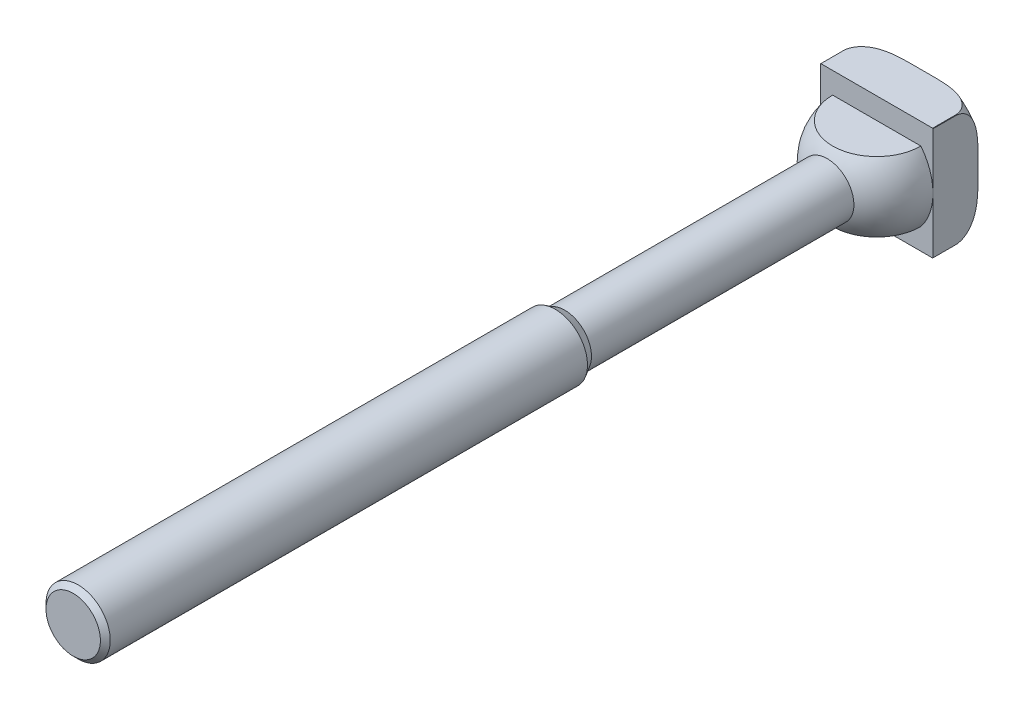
ISO-10303-21;
HEADER;
FILE_DESCRIPTION(('STEP AP214'),'2;1');
FILE_NAME('part.step','',(''),(''),'','','');
FILE_SCHEMA(('AUTOMOTIVE_DESIGN { 1 0 10303 214 1 1 1 1 }'));
ENDSEC;
DATA;
#1=APPLICATION_CONTEXT('core data for automotive mechanical design processes');
#2=APPLICATION_PROTOCOL_DEFINITION('international standard','automotive_design',2000,#1);
#3=PRODUCT_CONTEXT('',#1,'mechanical');
#4=PRODUCT('Part','Part','',(#3));
#5=PRODUCT_RELATED_PRODUCT_CATEGORY('part','',(#4));
#6=PRODUCT_DEFINITION_FORMATION('','',#4);
#7=PRODUCT_DEFINITION_CONTEXT('part definition',#1,'design');
#8=PRODUCT_DEFINITION('design','',#6,#7);
#9=PRODUCT_DEFINITION_SHAPE('','',#8);
#10=(LENGTH_UNIT() NAMED_UNIT(*) SI_UNIT(.MILLI.,.METRE.));
#11=(NAMED_UNIT(*) PLANE_ANGLE_UNIT() SI_UNIT($,.RADIAN.));
#12=(NAMED_UNIT(*) SI_UNIT($,.STERADIAN.) SOLID_ANGLE_UNIT());
#13=UNCERTAINTY_MEASURE_WITH_UNIT(LENGTH_MEASURE(1.E-05),#10,'distance_accuracy_value','');
#14=(GEOMETRIC_REPRESENTATION_CONTEXT(3) GLOBAL_UNCERTAINTY_ASSIGNED_CONTEXT((#13)) GLOBAL_UNIT_ASSIGNED_CONTEXT((#10,
#11,#12)) REPRESENTATION_CONTEXT('',''));
#15=CARTESIAN_POINT('',(0.,0.,0.));
#16=DIRECTION('',(0.,0.,1.));
#17=DIRECTION('',(1.,0.,0.));
#18=AXIS2_PLACEMENT_3D('',#15,#16,#17);
#19=CARTESIAN_POINT('',(0.,0.,-7.));
#20=DIRECTION('',(0.,0.,1.));
#21=DIRECTION('',(0.,1.,0.));
#22=AXIS2_PLACEMENT_3D('',#19,#20,#21);
#23=TOROIDAL_SURFACE('',#22,17.675,7.);
#24=CARTESIAN_POINT('',(-17.5,0.,-13.9978121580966));
#25=CARTESIAN_POINT('',(-17.5,-0.388449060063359,-13.9978135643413));
#26=CARTESIAN_POINT('',(-17.5,-0.776898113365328,-13.9981723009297));
#27=CARTESIAN_POINT('',(-17.5,-1.55379576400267,-13.9991757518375));
#28=CARTESIAN_POINT('',(-17.5,-1.94224436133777,-13.9998204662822));
#29=CARTESIAN_POINT('',(-17.5,-2.71944594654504,-14.0001197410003));
#30=CARTESIAN_POINT('',(-17.5,-3.10819893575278,-13.9997735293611));
#31=CARTESIAN_POINT('',(-17.5,-3.88570470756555,-13.9960499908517));
#32=CARTESIAN_POINT('',(-17.5,-4.27445748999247,-13.9926725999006));
#33=CARTESIAN_POINT('',(-17.5,-5.05178059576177,-13.9801914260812));
#34=CARTESIAN_POINT('',(-17.5,-5.44035094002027,-13.9710891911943));
#35=CARTESIAN_POINT('',(-17.5,-6.21718955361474,-13.9439137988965));
#36=CARTESIAN_POINT('',(-17.5,-6.60545783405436,-13.925840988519));
#37=CARTESIAN_POINT('',(-17.5,-7.38071641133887,-13.8770435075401));
#38=CARTESIAN_POINT('',(-17.5,-7.76770772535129,-13.8463359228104));
#39=CARTESIAN_POINT('',(-17.5,-8.54012803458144,-13.7681554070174));
#40=CARTESIAN_POINT('',(-17.5,-8.92555672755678,-13.7206793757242));
#41=CARTESIAN_POINT('',(-17.5,-9.7004715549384,-13.60339673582));
#42=CARTESIAN_POINT('',(-17.5,-10.0898988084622,-13.5331891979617));
#43=CARTESIAN_POINT('',(-17.5,-10.862789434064,-13.3656834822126));
#44=CARTESIAN_POINT('',(-17.5,-11.2462560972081,-13.2684008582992));
#45=CARTESIAN_POINT('',(-17.5,-12.0018639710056,-13.0419072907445));
#46=CARTESIAN_POINT('',(-17.5,-12.3740499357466,-12.9128485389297));
#47=CARTESIAN_POINT('',(-17.5,-13.1030630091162,-12.6173528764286));
#48=CARTESIAN_POINT('',(-17.5,-13.4599078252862,-12.4509605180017));
#49=CARTESIAN_POINT('',(-17.5,-14.1420716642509,-12.0805223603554));
#50=CARTESIAN_POINT('',(-17.5,-14.4679611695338,-11.8775401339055));
#51=CARTESIAN_POINT('',(-17.5,-15.0887495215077,-11.4272204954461));
#52=CARTESIAN_POINT('',(-17.5,-15.3836232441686,-11.1798475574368));
#53=CARTESIAN_POINT('',(-17.5,-15.7939764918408,-10.7735991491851));
#54=CARTESIAN_POINT('',(-17.5,-15.9261224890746,-10.631366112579));
#55=CARTESIAN_POINT('',(-17.5,-16.1771074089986,-10.3356481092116));
#56=CARTESIAN_POINT('',(-17.5,-16.2959534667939,-10.182169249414));
#57=CARTESIAN_POINT('',(-17.5,-16.5182174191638,-9.86471839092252));
#58=CARTESIAN_POINT('',(-17.5,-16.621657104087,-9.7007616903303));
#59=CARTESIAN_POINT('',(-17.5,-16.8112745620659,-9.36316201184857));
#60=CARTESIAN_POINT('',(-17.5,-16.8974588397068,-9.18952271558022));
#61=CARTESIAN_POINT('',(-17.5,-17.0306833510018,-8.88040626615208));
#62=CARTESIAN_POINT('',(-17.5,-17.0820701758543,-8.74678868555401));
#63=CARTESIAN_POINT('',(-17.5,-17.1737078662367,-8.47579588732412));
#64=CARTESIAN_POINT('',(-17.5,-17.2139608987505,-8.33842140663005));
#65=CARTESIAN_POINT('',(-17.5,-17.2827502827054,-8.06081624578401));
#66=CARTESIAN_POINT('',(-17.5,-17.3112907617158,-7.92058659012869));
#67=CARTESIAN_POINT('',(-17.5,-17.3562505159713,-7.63818623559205));
#68=CARTESIAN_POINT('',(-17.5,-17.3726693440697,-7.49601546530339));
#69=CARTESIAN_POINT('',(-17.5,-17.3931454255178,-7.2105534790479));
#70=CARTESIAN_POINT('',(-17.5,-17.397182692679,-7.06726082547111));
#71=CARTESIAN_POINT('',(-17.5,-17.3927747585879,-6.7808164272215));
#72=CARTESIAN_POINT('',(-17.5,-17.384325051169,-6.63766475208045));
#73=CARTESIAN_POINT('',(-17.5,-17.3550717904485,-6.35267251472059));
#74=CARTESIAN_POINT('',(-17.5,-17.3342716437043,-6.21083160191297));
#75=CARTESIAN_POINT('',(-17.5,-17.2806315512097,-5.92939609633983));
#76=CARTESIAN_POINT('',(-17.5,-17.2477870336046,-5.7898023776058));
#77=CARTESIAN_POINT('',(-17.5,-17.1714713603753,-5.51717596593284));
#78=CARTESIAN_POINT('',(-17.5,-17.1282750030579,-5.38406622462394));
#79=CARTESIAN_POINT('',(-17.5,-17.031454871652,-5.12167690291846));
#80=CARTESIAN_POINT('',(-17.5,-16.9778274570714,-4.99239867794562));
#81=CARTESIAN_POINT('',(-17.5,-16.8023047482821,-4.61143348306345));
#82=CARTESIAN_POINT('',(-17.5,-16.6657030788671,-4.36638565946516));
#83=CARTESIAN_POINT('',(-17.5,-16.3450249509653,-3.87627597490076));
#84=CARTESIAN_POINT('',(-17.5,-16.1576961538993,-3.63337111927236));
#85=CARTESIAN_POINT('',(-17.5,-15.7511437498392,-3.17579814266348));
#86=CARTESIAN_POINT('',(-17.5,-15.5318923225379,-2.96115496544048));
#87=CARTESIAN_POINT('',(-17.5,-15.1166648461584,-2.60199856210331));
#88=CARTESIAN_POINT('',(-17.5,-14.925227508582,-2.45215518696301));
#89=CARTESIAN_POINT('',(-17.5,-14.5298270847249,-2.16994195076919));
#90=CARTESIAN_POINT('',(-17.5,-14.3258580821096,-2.03758043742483));
#91=CARTESIAN_POINT('',(-17.5,-13.6988818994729,-1.6653897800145));
#92=CARTESIAN_POINT('',(-17.5,-13.2609105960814,-1.45054196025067));
#93=CARTESIAN_POINT('',(-17.5,-12.4409472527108,-1.11157031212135));
#94=CARTESIAN_POINT('',(-17.5,-12.0626184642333,-0.97814210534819));
#95=CARTESIAN_POINT('',(-17.5,-11.2955303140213,-0.744772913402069));
#96=CARTESIAN_POINT('',(-17.5,-10.9067630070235,-0.644858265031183));
#97=CARTESIAN_POINT('',(-17.5,-10.121671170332,-0.47277573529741));
#98=CARTESIAN_POINT('',(-17.5,-9.72532251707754,-0.400721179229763));
#99=CARTESIAN_POINT('',(-17.5,-8.92940755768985,-0.27956258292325));
#100=CARTESIAN_POINT('',(-17.5,-8.52984271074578,-0.230448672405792));
#101=CARTESIAN_POINT('',(-17.5,-7.60752790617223,-0.137940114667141));
#102=CARTESIAN_POINT('',(-17.5,-7.08417339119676,-0.100798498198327));
#103=CARTESIAN_POINT('',(-17.5,-6.03635725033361,-0.0469308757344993));
#104=CARTESIAN_POINT('',(-17.5,-5.51189527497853,-0.0302127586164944));
#105=CARTESIAN_POINT('',(-17.5,-4.72472261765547,-0.0140997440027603));
#106=CARTESIAN_POINT('',(-17.5,-4.46208166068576,-0.010223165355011));
#107=CARTESIAN_POINT('',(-17.5,-3.93677626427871,-0.00457927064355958));
#108=CARTESIAN_POINT('',(-17.5,-3.67411182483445,-0.00281195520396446));
#109=CARTESIAN_POINT('',(-17.5,-3.14882284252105,-0.000594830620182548));
#110=CARTESIAN_POINT('',(-17.5,-2.88619830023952,-0.000144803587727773));
#111=CARTESIAN_POINT('',(-17.5,-2.36094969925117,8.43665232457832E-05));
#112=CARTESIAN_POINT('',(-17.5,-2.09832564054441,-0.000136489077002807));
#113=CARTESIAN_POINT('',(-17.5,-1.57325334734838,-0.000754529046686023));
#114=CARTESIAN_POINT('',(-17.5,-1.3108051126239,-0.00115159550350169));
#115=CARTESIAN_POINT('',(-17.5,-0.785908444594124,-0.00179565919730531));
#116=CARTESIAN_POINT('',(-17.5,-0.523460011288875,-0.00204265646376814));
#117=CARTESIAN_POINT('',(-17.5,0.00144887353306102,-0.00223622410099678));
#118=CARTESIAN_POINT('',(-17.5,0.263909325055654,-0.00218278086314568));
#119=CARTESIAN_POINT('',(-17.5,0.788829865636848,-0.00180601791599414));
#120=CARTESIAN_POINT('',(-17.5,1.05128995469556,-0.00148269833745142));
#121=CARTESIAN_POINT('',(-17.5,1.57605180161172,-0.000776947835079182));
#122=CARTESIAN_POINT('',(-17.5,1.83835355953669,-0.000394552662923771));
#123=CARTESIAN_POINT('',(-17.5,2.36295729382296,4.63168922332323E-05));
#124=CARTESIAN_POINT('',(-17.5,2.62525927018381,0.00010479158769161));
#125=CARTESIAN_POINT('',(-17.5,3.149853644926,-0.000647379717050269));
#126=CARTESIAN_POINT('',(-17.5,3.4121460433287,-0.00145799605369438));
#127=CARTESIAN_POINT('',(-17.5,3.93672069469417,-0.00464072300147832));
#128=CARTESIAN_POINT('',(-17.5,4.1990029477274,-0.00701281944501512));
#129=CARTESIAN_POINT('',(-17.5,4.65230158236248,-0.013176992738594));
#130=CARTESIAN_POINT('',(-17.5,4.84332513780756,-0.0164083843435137));
#131=CARTESIAN_POINT('',(-17.5,5.22533824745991,-0.0245003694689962));
#132=CARTESIAN_POINT('',(-17.5,5.41632780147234,-0.0293609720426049));
#133=CARTESIAN_POINT('',(-17.5,5.98924358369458,-0.0469622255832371));
#134=CARTESIAN_POINT('',(-17.5,6.37108844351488,-0.0627220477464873));
#135=CARTESIAN_POINT('',(-17.5,7.13466290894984,-0.105754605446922));
#136=CARTESIAN_POINT('',(-17.5,7.51639171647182,-0.133042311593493));
#137=CARTESIAN_POINT('',(-17.5,8.27847662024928,-0.202989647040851));
#138=CARTESIAN_POINT('',(-17.5,8.65883277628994,-0.245648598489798));
#139=CARTESIAN_POINT('',(-17.5,9.42195850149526,-0.351246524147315));
#140=CARTESIAN_POINT('',(-17.5,9.80469288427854,-0.414447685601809));
#141=CARTESIAN_POINT('',(-17.5,10.5654459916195,-0.565698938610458));
#142=CARTESIAN_POINT('',(-17.5,10.943463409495,-0.653755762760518));
#143=CARTESIAN_POINT('',(-17.5,11.6902728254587,-0.859393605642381));
#144=CARTESIAN_POINT('',(-17.5,12.0590899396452,-0.97688159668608));
#145=CARTESIAN_POINT('',(-17.5,12.7836720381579,-1.24650276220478));
#146=CARTESIAN_POINT('',(-17.5,13.1394491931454,-1.39860262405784));
#147=CARTESIAN_POINT('',(-17.5,13.8415571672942,-1.74733174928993));
#148=CARTESIAN_POINT('',(-17.5,14.1873239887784,-1.94511352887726));
#149=CARTESIAN_POINT('',(-17.5,14.8485763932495,-2.38739698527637));
#150=CARTESIAN_POINT('',(-17.5,15.1640528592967,-2.63191266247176));
#151=CARTESIAN_POINT('',(-17.5,15.6057116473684,-3.03656741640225));
#152=CARTESIAN_POINT('',(-17.5,15.7484799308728,-3.17879792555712));
#153=CARTESIAN_POINT('',(-17.5,16.02058218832,-3.47553091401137));
#154=CARTESIAN_POINT('',(-17.5,16.1499236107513,-3.6300265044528));
#155=CARTESIAN_POINT('',(-17.5,16.392848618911,-3.95063608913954));
#156=CARTESIAN_POINT('',(-17.5,16.5064542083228,-4.11673336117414));
#157=CARTESIAN_POINT('',(-17.5,16.7158362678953,-4.45979707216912));
#158=CARTESIAN_POINT('',(-17.5,16.8116204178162,-4.63675878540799));
#159=CARTESIAN_POINT('',(-17.5,16.9589551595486,-4.94876888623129));
#160=CARTESIAN_POINT('',(-17.5,17.0153588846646,-5.08154294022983));
#161=CARTESIAN_POINT('',(-17.5,17.117142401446,-5.35124238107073));
#162=CARTESIAN_POINT('',(-17.5,17.1625245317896,-5.48816688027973));
#163=CARTESIAN_POINT('',(-17.5,17.2416148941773,-5.76529141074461));
#164=CARTESIAN_POINT('',(-17.5,17.2753279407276,-5.90549006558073));
#165=CARTESIAN_POINT('',(-17.5,17.3306061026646,-6.18827496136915));
#166=CARTESIAN_POINT('',(-17.5,17.3521707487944,-6.3308612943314));
#167=CARTESIAN_POINT('',(-17.5,17.3828473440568,-6.61768637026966));
#168=CARTESIAN_POINT('',(-17.5,17.3919319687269,-6.76192804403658));
#169=CARTESIAN_POINT('',(-17.5,17.3974162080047,-7.05070537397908));
#170=CARTESIAN_POINT('',(-17.5,17.3938112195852,-7.1952411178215));
#171=CARTESIAN_POINT('',(-17.5,17.3739668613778,-7.48339401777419));
#172=CARTESIAN_POINT('',(-17.5,17.3577315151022,-7.62701145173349));
#173=CARTESIAN_POINT('',(-17.5,17.3128806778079,-7.9123497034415));
#174=CARTESIAN_POINT('',(-17.5,17.2842605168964,-8.05406978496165));
#175=CARTESIAN_POINT('',(-17.5,17.216265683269,-8.32972580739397));
#176=CARTESIAN_POINT('',(-17.5,17.1772954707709,-8.46376171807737));
#177=CARTESIAN_POINT('',(-17.5,17.0887514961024,-8.72830148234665));
#178=CARTESIAN_POINT('',(-17.5,17.0391740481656,-8.85880409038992));
#179=CARTESIAN_POINT('',(-17.5,16.8754700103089,-9.2438384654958));
#180=CARTESIAN_POINT('',(-17.5,16.7463149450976,-9.49212171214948));
#181=CARTESIAN_POINT('',(-17.5,16.4418120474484,-9.98701450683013));
#182=CARTESIAN_POINT('',(-17.5,16.2635309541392,-10.2317936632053));
#183=CARTESIAN_POINT('',(-17.5,15.8745026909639,-10.6940423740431));
#184=CARTESIAN_POINT('',(-17.5,15.6637350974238,-10.911494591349));
#185=CARTESIAN_POINT('',(-17.5,15.2660576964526,-11.2735884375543));
#186=CARTESIAN_POINT('',(-17.5,15.0840775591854,-11.4237312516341));
#187=CARTESIAN_POINT('',(-17.5,14.7075403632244,-11.7073892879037));
#188=CARTESIAN_POINT('',(-17.5,14.5129776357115,-11.8408969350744));
#189=CARTESIAN_POINT('',(-17.5,13.9137092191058,-12.2177425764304));
#190=CARTESIAN_POINT('',(-17.5,13.4937742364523,-12.4370952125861));
#191=CARTESIAN_POINT('',(-17.5,12.7133171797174,-12.7823631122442));
#192=CARTESIAN_POINT('',(-17.5,12.3569593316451,-12.9181401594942));
#193=CARTESIAN_POINT('',(-17.5,11.6335174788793,-13.1580292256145));
#194=CARTESIAN_POINT('',(-17.5,11.2664258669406,-13.2621181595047));
#195=CARTESIAN_POINT('',(-17.5,10.5251422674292,-13.443446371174));
#196=CARTESIAN_POINT('',(-17.5,10.1509388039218,-13.5206375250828));
#197=CARTESIAN_POINT('',(-17.5,9.39854189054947,-13.6526484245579));
#198=CARTESIAN_POINT('',(-17.5,9.0203469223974,-13.7074593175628));
#199=CARTESIAN_POINT('',(-17.5,8.28352844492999,-13.7964449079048));
#200=CARTESIAN_POINT('',(-17.5,7.92502154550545,-13.8316198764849));
#201=CARTESIAN_POINT('',(-17.5,7.20708250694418,-13.8893676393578));
#202=CARTESIAN_POINT('',(-17.5,6.84765051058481,-13.911942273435));
#203=CARTESIAN_POINT('',(-17.5,6.12802310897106,-13.9476437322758));
#204=CARTESIAN_POINT('',(-17.5,5.76782730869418,-13.9607621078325));
#205=CARTESIAN_POINT('',(-17.5,5.04725920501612,-13.9803383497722));
#206=CARTESIAN_POINT('',(-17.5,4.68688689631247,-13.9867960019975));
#207=CARTESIAN_POINT('',(-17.5,3.96586036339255,-13.9955068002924));
#208=CARTESIAN_POINT('',(-17.5,3.60520611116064,-13.9977571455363));
#209=CARTESIAN_POINT('',(-17.5,2.88389986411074,-14.0000731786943));
#210=CARTESIAN_POINT('',(-17.5,2.52324786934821,-14.0001389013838));
#211=CARTESIAN_POINT('',(-17.5,1.8021635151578,-13.9996106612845));
#212=CARTESIAN_POINT('',(-17.5,1.44173115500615,-13.9990170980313));
#213=CARTESIAN_POINT('',(-17.5,0.720865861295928,-13.9981171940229));
#214=CARTESIAN_POINT('',(-17.5,0.360432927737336,-13.9978108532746));
#215=CARTESIAN_POINT('',(-17.5,0.,-13.9978121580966));
#216=B_SPLINE_CURVE_WITH_KNOTS('',3,(#24,#25,#26,#27,#28,#29,#30,#31,#32,#33,#34,#35,#36,#37,
#38,#39,#40,#41,#42,#43,#44,#45,#46,#47,#48,#49,#50,#51,#52,#53,#54,#55,#56,#57,#58,#59,#60,#61,
#62,#63,#64,#65,#66,#67,#68,#69,#70,#71,#72,#73,#74,#75,#76,#77,#78,#79,#80,#81,#82,#83,#84,#85,
#86,#87,#88,#89,#90,#91,#92,#93,#94,#95,#96,#97,#98,#99,#100,#101,#102,#103,#104,#105,#106,#107,
#108,#109,#110,#111,#112,#113,#114,#115,#116,#117,#118,#119,#120,#121,#122,#123,#124,#125,#126,
#127,#128,#129,#130,#131,#132,#133,#134,#135,#136,#137,#138,#139,#140,#141,#142,#143,#144,#145,
#146,#147,#148,#149,#150,#151,#152,#153,#154,#155,#156,#157,#158,#159,#160,#161,#162,#163,#164,
#165,#166,#167,#168,#169,#170,#171,#172,#173,#174,#175,#176,#177,#178,#179,#180,#181,#182,#183,
#184,#185,#186,#187,#188,#189,#190,#191,#192,#193,#194,#195,#196,#197,#198,#199,#200,#201,#202,
#203,#204,#205,#206,#207,#208,#209,#210,#211,#212,#213,#214,#215),.UNSPECIFIED.,.T.,.F.,(4,2,2,
2,2,2,2,2,2,2,2,2,2,2,2,2,2,2,2,2,2,2,2,2,2,2,2,2,2,2,2,2,2,2,2,2,2,2,2,2,2,2,2,2,2,2,2,2,2,2,2,
2,2,2,2,2,2,2,2,2,2,2,2,2,2,2,2,2,2,2,2,2,2,2,2,2,2,2,2,2,2,2,2,2,2,2,2,2,2,2,2,2,2,2,2,4),(0.,
1.16534717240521,2.33069485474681,3.49695056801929,4.66323093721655,5.82919608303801,
6.99511612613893,8.15946466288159,9.32402858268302,10.5103669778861,11.6960252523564,
12.8761116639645,14.0547972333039,15.2035486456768,16.353223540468,16.9350159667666,
17.5164947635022,18.09714315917,18.6775722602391,19.1066044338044,19.5355530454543,
19.9643503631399,20.3931634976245,20.8226684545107,21.2523284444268,21.6818699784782,
22.1115747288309,22.5309369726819,22.9504458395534,23.7887527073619,24.7057344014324,
25.6235200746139,26.3518416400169,27.0805097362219,28.5382509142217,29.7401885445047,
30.943068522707,32.150791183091,33.3579937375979,34.9313525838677,36.5053189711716,
37.2933227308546,38.0813267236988,38.8692003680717,39.6570724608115,40.4444181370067,
41.2317636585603,42.019144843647,42.8065256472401,43.5934317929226,44.3803371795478,
45.1672157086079,45.9540870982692,46.5272334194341,47.1003829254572,48.2467673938,
49.3946452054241,50.5424724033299,51.7055662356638,52.8689754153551,54.028752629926,
55.1874182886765,56.3793313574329,57.5716020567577,58.1754983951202,58.7790579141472,
59.3817647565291,59.9842112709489,60.4165476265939,60.8487921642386,61.280858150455,
61.7129408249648,62.1459680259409,62.5791523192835,63.0121986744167,63.4454084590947,
63.8636941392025,64.282125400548,65.1182997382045,66.0235061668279,66.9292840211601,
67.6360904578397,68.3432175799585,69.7588553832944,70.9014301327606,72.0448352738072,
73.1902757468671,74.3361688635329,75.4165796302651,76.4968326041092,77.5780495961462,
78.6593013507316,79.741272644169,80.8232267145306,81.9045254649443,82.9858242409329),.UNSPECIFIED.);
#217=CARTESIAN_POINT('',(-17.5,-2.48105320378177,-14.));
#218=VERTEX_POINT('',#217);
#219=CARTESIAN_POINT('',(-17.5,-17.3955633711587,-7.));
#220=VERTEX_POINT('',#219);
#221=EDGE_CURVE('E140',#218,#220,#216,.T.);
#222=ORIENTED_EDGE('',*,*,#221,.F.);
#223=CARTESIAN_POINT('',(0.,0.,-14.));
#224=DIRECTION('',(0.,0.,1.));
#225=DIRECTION('',(0.,1.,0.));
#226=AXIS2_PLACEMENT_3D('',#223,#224,#225);
#227=CIRCLE('',#226,17.675);
#228=CARTESIAN_POINT('',(-2.48105320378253,-17.5,-14.));
#229=VERTEX_POINT('',#228);
#230=EDGE_CURVE('E239',#218,#229,#227,.T.);
#231=ORIENTED_EDGE('',*,*,#230,.T.);
#232=CARTESIAN_POINT('',(0.,-17.5,-13.9978121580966));
#233=CARTESIAN_POINT('',(0.388449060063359,-17.5,-13.9978135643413));
#234=CARTESIAN_POINT('',(0.776898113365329,-17.5,-13.9981723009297));
#235=CARTESIAN_POINT('',(1.55379576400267,-17.5,-13.9991757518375));
#236=CARTESIAN_POINT('',(1.94224436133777,-17.5,-13.9998204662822));
#237=CARTESIAN_POINT('',(2.71944594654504,-17.5,-14.0001197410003));
#238=CARTESIAN_POINT('',(3.10819893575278,-17.5,-13.9997735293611));
#239=CARTESIAN_POINT('',(3.88570470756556,-17.5,-13.9960499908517));
#240=CARTESIAN_POINT('',(4.27445748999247,-17.5,-13.9926725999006));
#241=CARTESIAN_POINT('',(5.05178059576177,-17.5,-13.9801914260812));
#242=CARTESIAN_POINT('',(5.44035094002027,-17.5,-13.9710891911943));
#243=CARTESIAN_POINT('',(6.21718955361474,-17.5,-13.9439137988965));
#244=CARTESIAN_POINT('',(6.60545783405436,-17.5,-13.925840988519));
#245=CARTESIAN_POINT('',(7.38071641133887,-17.5,-13.8770435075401));
#246=CARTESIAN_POINT('',(7.76770772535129,-17.5,-13.8463359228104));
#247=CARTESIAN_POINT('',(8.54012803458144,-17.5,-13.7681554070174));
#248=CARTESIAN_POINT('',(8.92555672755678,-17.5,-13.7206793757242));
#249=CARTESIAN_POINT('',(9.70047155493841,-17.5,-13.60339673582));
#250=CARTESIAN_POINT('',(10.0898988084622,-17.5,-13.5331891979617));
#251=CARTESIAN_POINT('',(10.862789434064,-17.5,-13.3656834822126));
#252=CARTESIAN_POINT('',(11.2462560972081,-17.5,-13.2684008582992));
#253=CARTESIAN_POINT('',(12.0018639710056,-17.5,-13.0419072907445));
#254=CARTESIAN_POINT('',(12.3740499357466,-17.5,-12.9128485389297));
#255=CARTESIAN_POINT('',(13.1030630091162,-17.5,-12.6173528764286));
#256=CARTESIAN_POINT('',(13.4599078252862,-17.5,-12.4509605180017));
#257=CARTESIAN_POINT('',(14.1420716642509,-17.5,-12.0805223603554));
#258=CARTESIAN_POINT('',(14.4679611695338,-17.5,-11.8775401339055));
#259=CARTESIAN_POINT('',(15.0887495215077,-17.5,-11.4272204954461));
#260=CARTESIAN_POINT('',(15.3836232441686,-17.5,-11.1798475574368));
#261=CARTESIAN_POINT('',(15.7939764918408,-17.5,-10.7735991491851));
#262=CARTESIAN_POINT('',(15.9261224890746,-17.5,-10.631366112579));
#263=CARTESIAN_POINT('',(16.1771074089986,-17.5,-10.3356481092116));
#264=CARTESIAN_POINT('',(16.2959534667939,-17.5,-10.182169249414));
#265=CARTESIAN_POINT('',(16.5182174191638,-17.5,-9.86471839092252));
#266=CARTESIAN_POINT('',(16.621657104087,-17.5,-9.7007616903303));
#267=CARTESIAN_POINT('',(16.8112745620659,-17.5,-9.36316201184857));
#268=CARTESIAN_POINT('',(16.8974588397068,-17.5,-9.18952271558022));
#269=CARTESIAN_POINT('',(17.0306833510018,-17.5,-8.88040626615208));
#270=CARTESIAN_POINT('',(17.0820701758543,-17.5,-8.74678868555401));
#271=CARTESIAN_POINT('',(17.1737078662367,-17.5,-8.47579588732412));
#272=CARTESIAN_POINT('',(17.2139608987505,-17.5,-8.33842140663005));
#273=CARTESIAN_POINT('',(17.2827502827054,-17.5,-8.06081624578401));
#274=CARTESIAN_POINT('',(17.3112907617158,-17.5,-7.92058659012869));
#275=CARTESIAN_POINT('',(17.3562505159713,-17.5,-7.63818623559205));
#276=CARTESIAN_POINT('',(17.3726693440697,-17.5,-7.4960154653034));
#277=CARTESIAN_POINT('',(17.3931454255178,-17.5,-7.2105534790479));
#278=CARTESIAN_POINT('',(17.397182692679,-17.5,-7.06726082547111));
#279=CARTESIAN_POINT('',(17.3927747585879,-17.5,-6.78081642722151));
#280=CARTESIAN_POINT('',(17.384325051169,-17.5,-6.63766475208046));
#281=CARTESIAN_POINT('',(17.3550717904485,-17.5,-6.35267251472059));
#282=CARTESIAN_POINT('',(17.3342716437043,-17.5,-6.21083160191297));
#283=CARTESIAN_POINT('',(17.2806315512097,-17.5,-5.92939609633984));
#284=CARTESIAN_POINT('',(17.2477870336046,-17.5,-5.78980237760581));
#285=CARTESIAN_POINT('',(17.1714713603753,-17.5,-5.51717596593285));
#286=CARTESIAN_POINT('',(17.1282750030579,-17.5,-5.38406622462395));
#287=CARTESIAN_POINT('',(17.031454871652,-17.5,-5.12167690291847));
#288=CARTESIAN_POINT('',(16.9778274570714,-17.5,-4.99239867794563));
#289=CARTESIAN_POINT('',(16.8023047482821,-17.5,-4.61143348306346));
#290=CARTESIAN_POINT('',(16.6657030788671,-17.5,-4.36638565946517));
#291=CARTESIAN_POINT('',(16.3450249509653,-17.5,-3.87627597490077));
#292=CARTESIAN_POINT('',(16.1576961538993,-17.5,-3.63337111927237));
#293=CARTESIAN_POINT('',(15.7511437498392,-17.5,-3.17579814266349));
#294=CARTESIAN_POINT('',(15.5318923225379,-17.5,-2.96115496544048));
#295=CARTESIAN_POINT('',(15.1166648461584,-17.5,-2.60199856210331));
#296=CARTESIAN_POINT('',(14.925227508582,-17.5,-2.45215518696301));
#297=CARTESIAN_POINT('',(14.5298270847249,-17.5,-2.1699419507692));
#298=CARTESIAN_POINT('',(14.3258580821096,-17.5,-2.03758043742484));
#299=CARTESIAN_POINT('',(13.6988818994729,-17.5,-1.66538978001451));
#300=CARTESIAN_POINT('',(13.2609105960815,-17.5,-1.45054196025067));
#301=CARTESIAN_POINT('',(12.4409472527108,-17.5,-1.11157031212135));
#302=CARTESIAN_POINT('',(12.0626184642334,-17.5,-0.978142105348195));
#303=CARTESIAN_POINT('',(11.2955303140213,-17.5,-0.744772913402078));
#304=CARTESIAN_POINT('',(10.9067630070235,-17.5,-0.64485826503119));
#305=CARTESIAN_POINT('',(10.121671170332,-17.5,-0.472775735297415));
#306=CARTESIAN_POINT('',(9.72532251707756,-17.5,-0.400721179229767));
#307=CARTESIAN_POINT('',(8.92940755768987,-17.5,-0.279562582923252));
#308=CARTESIAN_POINT('',(8.5298427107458,-17.5,-0.230448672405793));
#309=CARTESIAN_POINT('',(7.60752790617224,-17.5,-0.13794011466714));
#310=CARTESIAN_POINT('',(7.08417339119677,-17.5,-0.100798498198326));
#311=CARTESIAN_POINT('',(6.03635725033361,-17.5,-0.0469308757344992));
#312=CARTESIAN_POINT('',(5.51189527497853,-17.5,-0.0302127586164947));
#313=CARTESIAN_POINT('',(4.72472261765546,-17.5,-0.0140997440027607));
#314=CARTESIAN_POINT('',(4.46208166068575,-17.5,-0.0102231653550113));
#315=CARTESIAN_POINT('',(3.9367762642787,-17.5,-0.00457927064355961));
#316=CARTESIAN_POINT('',(3.67411182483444,-17.5,-0.00281195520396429));
#317=CARTESIAN_POINT('',(3.14882284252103,-17.5,-0.000594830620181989));
#318=CARTESIAN_POINT('',(2.88619830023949,-17.5,-0.000144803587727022));
#319=CARTESIAN_POINT('',(2.36094969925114,-17.5,8.43665232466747E-05));
#320=CARTESIAN_POINT('',(2.09832564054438,-17.5,-0.000136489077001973));
#321=CARTESIAN_POINT('',(1.57325334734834,-17.5,-0.000754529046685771));
#322=CARTESIAN_POINT('',(1.31080511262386,-17.5,-0.00115159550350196));
#323=CARTESIAN_POINT('',(0.785908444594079,-17.5,-0.00179565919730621));
#324=CARTESIAN_POINT('',(0.52346001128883,-17.5,-0.00204265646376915));
#325=CARTESIAN_POINT('',(-0.00144887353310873,-17.5,-0.002236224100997));
#326=CARTESIAN_POINT('',(-0.263909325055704,-17.5,-0.00218278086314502));
#327=CARTESIAN_POINT('',(-0.788829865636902,-17.5,-0.00180601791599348));
#328=CARTESIAN_POINT('',(-1.05128995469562,-17.5,-0.00148269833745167));
#329=CARTESIAN_POINT('',(-1.57605180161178,-17.5,-0.000776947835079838));
#330=CARTESIAN_POINT('',(-1.83835355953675,-17.5,-0.000394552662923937));
#331=CARTESIAN_POINT('',(-2.36295729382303,-17.5,4.63168922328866E-05));
#332=CARTESIAN_POINT('',(-2.62525927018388,-17.5,0.000104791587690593));
#333=CARTESIAN_POINT('',(-3.14985364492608,-17.5,-0.000647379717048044));
#334=CARTESIAN_POINT('',(-3.41214604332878,-17.5,-0.00145799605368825));
#335=CARTESIAN_POINT('',(-3.93672069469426,-17.5,-0.00464072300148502));
#336=CARTESIAN_POINT('',(-4.19900294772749,-17.5,-0.00701281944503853));
#337=CARTESIAN_POINT('',(-4.65230158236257,-17.5,-0.0131769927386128));
#338=CARTESIAN_POINT('',(-4.84332513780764,-17.5,-0.0164083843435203));
#339=CARTESIAN_POINT('',(-5.22533824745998,-17.5,-0.0245003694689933));
#340=CARTESIAN_POINT('',(-5.41632780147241,-17.5,-0.0293609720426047));
#341=CARTESIAN_POINT('',(-5.98924358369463,-17.5,-0.0469622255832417));
#342=CARTESIAN_POINT('',(-6.37108844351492,-17.5,-0.0627220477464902));
#343=CARTESIAN_POINT('',(-7.13466290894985,-17.5,-0.105754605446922));
#344=CARTESIAN_POINT('',(-7.51639171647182,-17.5,-0.133042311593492));
#345=CARTESIAN_POINT('',(-8.27847662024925,-17.5,-0.20298964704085));
#346=CARTESIAN_POINT('',(-8.65883277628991,-17.5,-0.2456485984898));
#347=CARTESIAN_POINT('',(-9.4219585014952,-17.5,-0.351246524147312));
#348=CARTESIAN_POINT('',(-9.80469288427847,-17.5,-0.414447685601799));
#349=CARTESIAN_POINT('',(-10.5654459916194,-17.5,-0.565698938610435));
#350=CARTESIAN_POINT('',(-10.9434634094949,-17.5,-0.653755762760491));
#351=CARTESIAN_POINT('',(-11.6902728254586,-17.5,-0.859393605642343));
#352=CARTESIAN_POINT('',(-12.059089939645,-17.5,-0.976881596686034));
#353=CARTESIAN_POINT('',(-12.7836720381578,-17.5,-1.24650276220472));
#354=CARTESIAN_POINT('',(-13.1394491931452,-17.5,-1.39860262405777));
#355=CARTESIAN_POINT('',(-13.8415571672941,-17.5,-1.74733174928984));
#356=CARTESIAN_POINT('',(-14.1873239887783,-17.5,-1.94511352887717));
#357=CARTESIAN_POINT('',(-14.8485763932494,-17.5,-2.38739698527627));
#358=CARTESIAN_POINT('',(-15.1640528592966,-17.5,-2.63191266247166));
#359=CARTESIAN_POINT('',(-15.6057116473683,-17.5,-3.03656741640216));
#360=CARTESIAN_POINT('',(-15.7484799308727,-17.5,-3.17879792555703));
#361=CARTESIAN_POINT('',(-16.0205821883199,-17.5,-3.47553091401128));
#362=CARTESIAN_POINT('',(-16.1499236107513,-17.5,-3.63002650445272));
#363=CARTESIAN_POINT('',(-16.392848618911,-17.5,-3.95063608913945));
#364=CARTESIAN_POINT('',(-16.5064542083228,-17.5,-4.11673336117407));
#365=CARTESIAN_POINT('',(-16.7158362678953,-17.5,-4.45979707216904));
#366=CARTESIAN_POINT('',(-16.8116204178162,-17.5,-4.6367587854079));
#367=CARTESIAN_POINT('',(-16.9589551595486,-17.5,-4.9487688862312));
#368=CARTESIAN_POINT('',(-17.0153588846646,-17.5,-5.08154294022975));
#369=CARTESIAN_POINT('',(-17.117142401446,-17.5,-5.35124238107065));
#370=CARTESIAN_POINT('',(-17.1625245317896,-17.5,-5.48816688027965));
#371=CARTESIAN_POINT('',(-17.2416148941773,-17.5,-5.76529141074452));
#372=CARTESIAN_POINT('',(-17.2753279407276,-17.5,-5.90549006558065));
#373=CARTESIAN_POINT('',(-17.3306061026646,-17.5,-6.18827496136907));
#374=CARTESIAN_POINT('',(-17.3521707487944,-17.5,-6.33086129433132));
#375=CARTESIAN_POINT('',(-17.3828473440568,-17.5,-6.61768637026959));
#376=CARTESIAN_POINT('',(-17.3919319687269,-17.5,-6.76192804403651));
#377=CARTESIAN_POINT('',(-17.3974162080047,-17.5,-7.050705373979));
#378=CARTESIAN_POINT('',(-17.3938112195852,-17.5,-7.19524111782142));
#379=CARTESIAN_POINT('',(-17.3739668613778,-17.5,-7.48339401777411));
#380=CARTESIAN_POINT('',(-17.3577315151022,-17.5,-7.62701145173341));
#381=CARTESIAN_POINT('',(-17.3128806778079,-17.5,-7.91234970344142));
#382=CARTESIAN_POINT('',(-17.2842605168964,-17.5,-8.05406978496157));
#383=CARTESIAN_POINT('',(-17.2162656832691,-17.5,-8.32972580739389));
#384=CARTESIAN_POINT('',(-17.1772954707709,-17.5,-8.4637617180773));
#385=CARTESIAN_POINT('',(-17.0887514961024,-17.5,-8.72830148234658));
#386=CARTESIAN_POINT('',(-17.0391740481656,-17.5,-8.85880409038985));
#387=CARTESIAN_POINT('',(-16.875470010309,-17.5,-9.24383846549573));
#388=CARTESIAN_POINT('',(-16.7463149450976,-17.5,-9.49212171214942));
#389=CARTESIAN_POINT('',(-16.4418120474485,-17.5,-9.98701450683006));
#390=CARTESIAN_POINT('',(-16.2635309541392,-17.5,-10.2317936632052));
#391=CARTESIAN_POINT('',(-15.8745026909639,-17.5,-10.694042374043));
#392=CARTESIAN_POINT('',(-15.6637350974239,-17.5,-10.9114945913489));
#393=CARTESIAN_POINT('',(-15.2660576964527,-17.5,-11.2735884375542));
#394=CARTESIAN_POINT('',(-15.0840775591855,-17.5,-11.423731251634));
#395=CARTESIAN_POINT('',(-14.7075403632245,-17.5,-11.7073892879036));
#396=CARTESIAN_POINT('',(-14.5129776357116,-17.5,-11.8408969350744));
#397=CARTESIAN_POINT('',(-13.9137092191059,-17.5,-12.2177425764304));
#398=CARTESIAN_POINT('',(-13.4937742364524,-17.5,-12.437095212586));
#399=CARTESIAN_POINT('',(-12.7133171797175,-17.5,-12.7823631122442));
#400=CARTESIAN_POINT('',(-12.3569593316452,-17.5,-12.9181401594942));
#401=CARTESIAN_POINT('',(-11.6335174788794,-17.5,-13.1580292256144));
#402=CARTESIAN_POINT('',(-11.2664258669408,-17.5,-13.2621181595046));
#403=CARTESIAN_POINT('',(-10.5251422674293,-17.5,-13.4434463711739));
#404=CARTESIAN_POINT('',(-10.1509388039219,-17.5,-13.5206375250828));
#405=CARTESIAN_POINT('',(-9.39854189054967,-17.5,-13.6526484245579));
#406=CARTESIAN_POINT('',(-9.02034692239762,-17.5,-13.7074593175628));
#407=CARTESIAN_POINT('',(-8.28352844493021,-17.5,-13.7964449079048));
#408=CARTESIAN_POINT('',(-7.92502154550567,-17.5,-13.8316198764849));
#409=CARTESIAN_POINT('',(-7.20708250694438,-17.5,-13.8893676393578));
#410=CARTESIAN_POINT('',(-6.847650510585,-17.5,-13.911942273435));
#411=CARTESIAN_POINT('',(-6.12802310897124,-17.5,-13.9476437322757));
#412=CARTESIAN_POINT('',(-5.76782730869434,-17.5,-13.9607621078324));
#413=CARTESIAN_POINT('',(-5.04725920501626,-17.5,-13.9803383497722));
#414=CARTESIAN_POINT('',(-4.68688689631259,-17.5,-13.9867960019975));
#415=CARTESIAN_POINT('',(-3.96586036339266,-17.5,-13.9955068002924));
#416=CARTESIAN_POINT('',(-3.60520611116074,-17.5,-13.9977571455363));
#417=CARTESIAN_POINT('',(-2.88389986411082,-17.5,-14.0000731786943));
#418=CARTESIAN_POINT('',(-2.52324786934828,-17.5,-14.0001389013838));
#419=CARTESIAN_POINT('',(-1.80216351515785,-17.5,-13.9996106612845));
#420=CARTESIAN_POINT('',(-1.44173115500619,-17.5,-13.9990170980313));
#421=CARTESIAN_POINT('',(-0.720865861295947,-17.5,-13.9981171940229));
#422=CARTESIAN_POINT('',(-0.360432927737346,-17.5,-13.9978108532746));
#423=CARTESIAN_POINT('',(0.,-17.5,-13.9978121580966));
#424=B_SPLINE_CURVE_WITH_KNOTS('',3,(#232,#233,#234,#235,#236,#237,#238,#239,#240,#241,#242,
#243,#244,#245,#246,#247,#248,#249,#250,#251,#252,#253,#254,#255,#256,#257,#258,#259,#260,#261,
#262,#263,#264,#265,#266,#267,#268,#269,#270,#271,#272,#273,#274,#275,#276,#277,#278,#279,#280,
#281,#282,#283,#284,#285,#286,#287,#288,#289,#290,#291,#292,#293,#294,#295,#296,#297,#298,#299,
#300,#301,#302,#303,#304,#305,#306,#307,#308,#309,#310,#311,#312,#313,#314,#315,#316,#317,#318,
#319,#320,#321,#322,#323,#324,#325,#326,#327,#328,#329,#330,#331,#332,#333,#334,#335,#336,#337,
#338,#339,#340,#341,#342,#343,#344,#345,#346,#347,#348,#349,#350,#351,#352,#353,#354,#355,#356,
#357,#358,#359,#360,#361,#362,#363,#364,#365,#366,#367,#368,#369,#370,#371,#372,#373,#374,#375,
#376,#377,#378,#379,#380,#381,#382,#383,#384,#385,#386,#387,#388,#389,#390,#391,#392,#393,#394,
#395,#396,#397,#398,#399,#400,#401,#402,#403,#404,#405,#406,#407,#408,#409,#410,#411,#412,#413,
#414,#415,#416,#417,#418,#419,#420,#421,#422,#423),.UNSPECIFIED.,.T.,.F.,(4,2,2,2,2,2,2,2,2,2,2,
2,2,2,2,2,2,2,2,2,2,2,2,2,2,2,2,2,2,2,2,2,2,2,2,2,2,2,2,2,2,2,2,2,2,2,2,2,2,2,2,2,2,2,2,2,2,2,2,
2,2,2,2,2,2,2,2,2,2,2,2,2,2,2,2,2,2,2,2,2,2,2,2,2,2,2,2,2,2,2,2,2,2,2,2,4),(0.,1.16534717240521,
2.33069485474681,3.4969505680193,4.66323093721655,5.82919608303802,6.99511612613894,
8.15946466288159,9.32402858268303,10.5103669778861,11.6960252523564,12.8761116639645,
14.0547972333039,15.2035486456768,16.353223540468,16.9350159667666,17.5164947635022,
18.09714315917,18.6775722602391,19.1066044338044,19.5355530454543,19.9643503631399,
20.3931634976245,20.8226684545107,21.2523284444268,21.6818699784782,22.1115747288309,
22.5309369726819,22.9504458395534,23.7887527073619,24.7057344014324,25.6235200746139,
26.3518416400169,27.0805097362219,28.5382509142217,29.7401885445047,30.943068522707,
32.1507911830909,33.3579937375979,34.9313525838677,36.5053189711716,37.2933227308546,
38.0813267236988,38.8692003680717,39.6570724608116,40.4444181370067,41.2317636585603,
42.0191448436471,42.8065256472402,43.5934317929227,44.3803371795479,45.167215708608,
45.9540870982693,46.5272334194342,47.1003829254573,48.2467673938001,49.3946452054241,
50.5424724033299,51.7055662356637,52.868975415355,54.0287526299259,55.1874182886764,
56.3793313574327,57.5716020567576,58.1754983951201,58.7790579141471,59.381764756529,
59.9842112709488,60.4165476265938,60.8487921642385,61.2808581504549,61.7129408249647,
62.1459680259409,62.5791523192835,63.0121986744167,63.4454084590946,63.8636941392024,
64.282125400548,65.1182997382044,66.0235061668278,66.92928402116,67.6360904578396,
68.3432175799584,69.7588553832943,70.9014301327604,72.044835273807,73.190275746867,
74.3361688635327,75.4165796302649,76.496832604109,77.5780495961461,78.6593013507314,
79.7412726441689,80.8232267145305,81.9045254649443,82.9858242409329),.UNSPECIFIED.);
#425=CARTESIAN_POINT('',(-17.3955633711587,-17.5,-7.));
#426=VERTEX_POINT('',#425);
#427=EDGE_CURVE('E177',#426,#229,#424,.T.);
#428=ORIENTED_EDGE('',*,*,#427,.F.);
#429=CARTESIAN_POINT('',(0.,0.,-7.));
#430=DIRECTION('',(0.,0.,1.));
#431=DIRECTION('',(0.,1.,0.));
#432=AXIS2_PLACEMENT_3D('',#429,#430,#431);
#433=CIRCLE('',#432,24.675);
#434=EDGE_CURVE('E174',#220,#426,#433,.T.);
#435=ORIENTED_EDGE('',*,*,#434,.F.);
#436=EDGE_LOOP('',(#222,#231,#428,#435));
#437=FACE_BOUND('',#436,.T.);
#438=ADVANCED_FACE('F14',(#437),#23,.T.);
#439=CARTESIAN_POINT('',(2.48105320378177,-17.5,-14.));
#440=VERTEX_POINT('',#439);
#441=CARTESIAN_POINT('',(17.3955633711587,-17.5,-7.));
#442=VERTEX_POINT('',#441);
#443=EDGE_CURVE('E180',#440,#442,#424,.T.);
#444=ORIENTED_EDGE('',*,*,#443,.F.);
#445=CARTESIAN_POINT('',(17.5,-2.48105320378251,-14.));
#446=VERTEX_POINT('',#445);
#447=EDGE_CURVE('E338',#440,#446,#227,.T.);
#448=ORIENTED_EDGE('',*,*,#447,.T.);
#449=CARTESIAN_POINT('',(17.5,0.,-13.9978121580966));
#450=CARTESIAN_POINT('',(17.5,0.388449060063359,-13.9978135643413));
#451=CARTESIAN_POINT('',(17.5,0.776898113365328,-13.9981723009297));
#452=CARTESIAN_POINT('',(17.5,1.55379576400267,-13.9991757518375));
#453=CARTESIAN_POINT('',(17.5,1.94224436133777,-13.9998204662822));
#454=CARTESIAN_POINT('',(17.5,2.71944594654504,-14.0001197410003));
#455=CARTESIAN_POINT('',(17.5,3.10819893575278,-13.9997735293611));
#456=CARTESIAN_POINT('',(17.5,3.88570470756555,-13.9960499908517));
#457=CARTESIAN_POINT('',(17.5,4.27445748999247,-13.9926725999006));
#458=CARTESIAN_POINT('',(17.5,5.05178059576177,-13.9801914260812));
#459=CARTESIAN_POINT('',(17.5,5.44035094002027,-13.9710891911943));
#460=CARTESIAN_POINT('',(17.5,6.21718955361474,-13.9439137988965));
#461=CARTESIAN_POINT('',(17.5,6.60545783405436,-13.925840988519));
#462=CARTESIAN_POINT('',(17.5,7.38071641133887,-13.8770435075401));
#463=CARTESIAN_POINT('',(17.5,7.76770772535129,-13.8463359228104));
#464=CARTESIAN_POINT('',(17.5,8.54012803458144,-13.7681554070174));
#465=CARTESIAN_POINT('',(17.5,8.92555672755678,-13.7206793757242));
#466=CARTESIAN_POINT('',(17.5,9.7004715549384,-13.60339673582));
#467=CARTESIAN_POINT('',(17.5,10.0898988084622,-13.5331891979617));
#468=CARTESIAN_POINT('',(17.5,10.862789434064,-13.3656834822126));
#469=CARTESIAN_POINT('',(17.5,11.2462560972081,-13.2684008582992));
#470=CARTESIAN_POINT('',(17.5,12.0018639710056,-13.0419072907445));
#471=CARTESIAN_POINT('',(17.5,12.3740499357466,-12.9128485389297));
#472=CARTESIAN_POINT('',(17.5,13.1030630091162,-12.6173528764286));
#473=CARTESIAN_POINT('',(17.5,13.4599078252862,-12.4509605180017));
#474=CARTESIAN_POINT('',(17.5,14.1420716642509,-12.0805223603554));
#475=CARTESIAN_POINT('',(17.5,14.4679611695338,-11.8775401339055));
#476=CARTESIAN_POINT('',(17.5,15.0887495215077,-11.4272204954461));
#477=CARTESIAN_POINT('',(17.5,15.3836232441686,-11.1798475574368));
#478=CARTESIAN_POINT('',(17.5,15.7939764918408,-10.7735991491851));
#479=CARTESIAN_POINT('',(17.5,15.9261224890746,-10.631366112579));
#480=CARTESIAN_POINT('',(17.5,16.1771074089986,-10.3356481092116));
#481=CARTESIAN_POINT('',(17.5,16.2959534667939,-10.182169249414));
#482=CARTESIAN_POINT('',(17.5,16.5182174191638,-9.86471839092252));
#483=CARTESIAN_POINT('',(17.5,16.621657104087,-9.7007616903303));
#484=CARTESIAN_POINT('',(17.5,16.8112745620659,-9.36316201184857));
#485=CARTESIAN_POINT('',(17.5,16.8974588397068,-9.18952271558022));
#486=CARTESIAN_POINT('',(17.5,17.0306833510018,-8.88040626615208));
#487=CARTESIAN_POINT('',(17.5,17.0820701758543,-8.74678868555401));
#488=CARTESIAN_POINT('',(17.5,17.1737078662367,-8.47579588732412));
#489=CARTESIAN_POINT('',(17.5,17.2139608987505,-8.33842140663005));
#490=CARTESIAN_POINT('',(17.5,17.2827502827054,-8.06081624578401));
#491=CARTESIAN_POINT('',(17.5,17.3112907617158,-7.92058659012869));
#492=CARTESIAN_POINT('',(17.5,17.3562505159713,-7.63818623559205));
#493=CARTESIAN_POINT('',(17.5,17.3726693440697,-7.49601546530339));
#494=CARTESIAN_POINT('',(17.5,17.3931454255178,-7.2105534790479));
#495=CARTESIAN_POINT('',(17.5,17.397182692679,-7.06726082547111));
#496=CARTESIAN_POINT('',(17.5,17.3927747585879,-6.7808164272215));
#497=CARTESIAN_POINT('',(17.5,17.384325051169,-6.63766475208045));
#498=CARTESIAN_POINT('',(17.5,17.3550717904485,-6.35267251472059));
#499=CARTESIAN_POINT('',(17.5,17.3342716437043,-6.21083160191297));
#500=CARTESIAN_POINT('',(17.5,17.2806315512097,-5.92939609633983));
#501=CARTESIAN_POINT('',(17.5,17.2477870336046,-5.7898023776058));
#502=CARTESIAN_POINT('',(17.5,17.1714713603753,-5.51717596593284));
#503=CARTESIAN_POINT('',(17.5,17.1282750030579,-5.38406622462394));
#504=CARTESIAN_POINT('',(17.5,17.031454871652,-5.12167690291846));
#505=CARTESIAN_POINT('',(17.5,16.9778274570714,-4.99239867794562));
#506=CARTESIAN_POINT('',(17.5,16.8023047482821,-4.61143348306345));
#507=CARTESIAN_POINT('',(17.5,16.6657030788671,-4.36638565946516));
#508=CARTESIAN_POINT('',(17.5,16.3450249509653,-3.87627597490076));
#509=CARTESIAN_POINT('',(17.5,16.1576961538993,-3.63337111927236));
#510=CARTESIAN_POINT('',(17.5,15.7511437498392,-3.17579814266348));
#511=CARTESIAN_POINT('',(17.5,15.5318923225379,-2.96115496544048));
#512=CARTESIAN_POINT('',(17.5,15.1166648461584,-2.60199856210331));
#513=CARTESIAN_POINT('',(17.5,14.925227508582,-2.45215518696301));
#514=CARTESIAN_POINT('',(17.5,14.5298270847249,-2.16994195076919));
#515=CARTESIAN_POINT('',(17.5,14.3258580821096,-2.03758043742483));
#516=CARTESIAN_POINT('',(17.5,13.6988818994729,-1.6653897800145));
#517=CARTESIAN_POINT('',(17.5,13.2609105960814,-1.45054196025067));
#518=CARTESIAN_POINT('',(17.5,12.4409472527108,-1.11157031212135));
#519=CARTESIAN_POINT('',(17.5,12.0626184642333,-0.97814210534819));
#520=CARTESIAN_POINT('',(17.5,11.2955303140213,-0.744772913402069));
#521=CARTESIAN_POINT('',(17.5,10.9067630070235,-0.644858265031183));
#522=CARTESIAN_POINT('',(17.5,10.121671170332,-0.47277573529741));
#523=CARTESIAN_POINT('',(17.5,9.72532251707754,-0.400721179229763));
#524=CARTESIAN_POINT('',(17.5,8.92940755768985,-0.27956258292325));
#525=CARTESIAN_POINT('',(17.5,8.52984271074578,-0.230448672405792));
#526=CARTESIAN_POINT('',(17.5,7.60752790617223,-0.137940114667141));
#527=CARTESIAN_POINT('',(17.5,7.08417339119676,-0.100798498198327));
#528=CARTESIAN_POINT('',(17.5,6.03635725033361,-0.0469308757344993));
#529=CARTESIAN_POINT('',(17.5,5.51189527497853,-0.0302127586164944));
#530=CARTESIAN_POINT('',(17.5,4.72472261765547,-0.0140997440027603));
#531=CARTESIAN_POINT('',(17.5,4.46208166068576,-0.010223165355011));
#532=CARTESIAN_POINT('',(17.5,3.93677626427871,-0.00457927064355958));
#533=CARTESIAN_POINT('',(17.5,3.67411182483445,-0.00281195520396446));
#534=CARTESIAN_POINT('',(17.5,3.14882284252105,-0.000594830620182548));
#535=CARTESIAN_POINT('',(17.5,2.88619830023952,-0.000144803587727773));
#536=CARTESIAN_POINT('',(17.5,2.36094969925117,8.43665232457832E-05));
#537=CARTESIAN_POINT('',(17.5,2.09832564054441,-0.000136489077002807));
#538=CARTESIAN_POINT('',(17.5,1.57325334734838,-0.000754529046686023));
#539=CARTESIAN_POINT('',(17.5,1.3108051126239,-0.00115159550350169));
#540=CARTESIAN_POINT('',(17.5,0.785908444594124,-0.00179565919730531));
#541=CARTESIAN_POINT('',(17.5,0.523460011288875,-0.00204265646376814));
#542=CARTESIAN_POINT('',(17.5,-0.00144887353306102,-0.00223622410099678));
#543=CARTESIAN_POINT('',(17.5,-0.263909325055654,-0.00218278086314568));
#544=CARTESIAN_POINT('',(17.5,-0.788829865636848,-0.00180601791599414));
#545=CARTESIAN_POINT('',(17.5,-1.05128995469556,-0.00148269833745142));
#546=CARTESIAN_POINT('',(17.5,-1.57605180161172,-0.000776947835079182));
#547=CARTESIAN_POINT('',(17.5,-1.83835355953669,-0.000394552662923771));
#548=CARTESIAN_POINT('',(17.5,-2.36295729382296,4.63168922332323E-05));
#549=CARTESIAN_POINT('',(17.5,-2.62525927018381,0.00010479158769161));
#550=CARTESIAN_POINT('',(17.5,-3.149853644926,-0.000647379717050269));
#551=CARTESIAN_POINT('',(17.5,-3.4121460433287,-0.00145799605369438));
#552=CARTESIAN_POINT('',(17.5,-3.93672069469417,-0.00464072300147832));
#553=CARTESIAN_POINT('',(17.5,-4.1990029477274,-0.00701281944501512));
#554=CARTESIAN_POINT('',(17.5,-4.65230158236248,-0.013176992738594));
#555=CARTESIAN_POINT('',(17.5,-4.84332513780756,-0.0164083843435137));
#556=CARTESIAN_POINT('',(17.5,-5.22533824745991,-0.0245003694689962));
#557=CARTESIAN_POINT('',(17.5,-5.41632780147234,-0.0293609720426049));
#558=CARTESIAN_POINT('',(17.5,-5.98924358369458,-0.0469622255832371));
#559=CARTESIAN_POINT('',(17.5,-6.37108844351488,-0.0627220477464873));
#560=CARTESIAN_POINT('',(17.5,-7.13466290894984,-0.105754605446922));
#561=CARTESIAN_POINT('',(17.5,-7.51639171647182,-0.133042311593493));
#562=CARTESIAN_POINT('',(17.5,-8.27847662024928,-0.202989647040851));
#563=CARTESIAN_POINT('',(17.5,-8.65883277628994,-0.245648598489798));
#564=CARTESIAN_POINT('',(17.5,-9.42195850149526,-0.351246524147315));
#565=CARTESIAN_POINT('',(17.5,-9.80469288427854,-0.414447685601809));
#566=CARTESIAN_POINT('',(17.5,-10.5654459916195,-0.565698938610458));
#567=CARTESIAN_POINT('',(17.5,-10.943463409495,-0.653755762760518));
#568=CARTESIAN_POINT('',(17.5,-11.6902728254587,-0.859393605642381));
#569=CARTESIAN_POINT('',(17.5,-12.0590899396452,-0.97688159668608));
#570=CARTESIAN_POINT('',(17.5,-12.7836720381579,-1.24650276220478));
#571=CARTESIAN_POINT('',(17.5,-13.1394491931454,-1.39860262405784));
#572=CARTESIAN_POINT('',(17.5,-13.8415571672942,-1.74733174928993));
#573=CARTESIAN_POINT('',(17.5,-14.1873239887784,-1.94511352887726));
#574=CARTESIAN_POINT('',(17.5,-14.8485763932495,-2.38739698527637));
#575=CARTESIAN_POINT('',(17.5,-15.1640528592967,-2.63191266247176));
#576=CARTESIAN_POINT('',(17.5,-15.6057116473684,-3.03656741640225));
#577=CARTESIAN_POINT('',(17.5,-15.7484799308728,-3.17879792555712));
#578=CARTESIAN_POINT('',(17.5,-16.02058218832,-3.47553091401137));
#579=CARTESIAN_POINT('',(17.5,-16.1499236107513,-3.6300265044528));
#580=CARTESIAN_POINT('',(17.5,-16.392848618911,-3.95063608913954));
#581=CARTESIAN_POINT('',(17.5,-16.5064542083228,-4.11673336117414));
#582=CARTESIAN_POINT('',(17.5,-16.7158362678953,-4.45979707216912));
#583=CARTESIAN_POINT('',(17.5,-16.8116204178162,-4.63675878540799));
#584=CARTESIAN_POINT('',(17.5,-16.9589551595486,-4.94876888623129));
#585=CARTESIAN_POINT('',(17.5,-17.0153588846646,-5.08154294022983));
#586=CARTESIAN_POINT('',(17.5,-17.117142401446,-5.35124238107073));
#587=CARTESIAN_POINT('',(17.5,-17.1625245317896,-5.48816688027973));
#588=CARTESIAN_POINT('',(17.5,-17.2416148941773,-5.76529141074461));
#589=CARTESIAN_POINT('',(17.5,-17.2753279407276,-5.90549006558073));
#590=CARTESIAN_POINT('',(17.5,-17.3306061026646,-6.18827496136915));
#591=CARTESIAN_POINT('',(17.5,-17.3521707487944,-6.3308612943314));
#592=CARTESIAN_POINT('',(17.5,-17.3828473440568,-6.61768637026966));
#593=CARTESIAN_POINT('',(17.5,-17.3919319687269,-6.76192804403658));
#594=CARTESIAN_POINT('',(17.5,-17.3974162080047,-7.05070537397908));
#595=CARTESIAN_POINT('',(17.5,-17.3938112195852,-7.1952411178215));
#596=CARTESIAN_POINT('',(17.5,-17.3739668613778,-7.48339401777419));
#597=CARTESIAN_POINT('',(17.5,-17.3577315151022,-7.62701145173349));
#598=CARTESIAN_POINT('',(17.5,-17.3128806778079,-7.9123497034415));
#599=CARTESIAN_POINT('',(17.5,-17.2842605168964,-8.05406978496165));
#600=CARTESIAN_POINT('',(17.5,-17.216265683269,-8.32972580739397));
#601=CARTESIAN_POINT('',(17.5,-17.1772954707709,-8.46376171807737));
#602=CARTESIAN_POINT('',(17.5,-17.0887514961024,-8.72830148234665));
#603=CARTESIAN_POINT('',(17.5,-17.0391740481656,-8.85880409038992));
#604=CARTESIAN_POINT('',(17.5,-16.8754700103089,-9.2438384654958));
#605=CARTESIAN_POINT('',(17.5,-16.7463149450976,-9.49212171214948));
#606=CARTESIAN_POINT('',(17.5,-16.4418120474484,-9.98701450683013));
#607=CARTESIAN_POINT('',(17.5,-16.2635309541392,-10.2317936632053));
#608=CARTESIAN_POINT('',(17.5,-15.8745026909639,-10.6940423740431));
#609=CARTESIAN_POINT('',(17.5,-15.6637350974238,-10.911494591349));
#610=CARTESIAN_POINT('',(17.5,-15.2660576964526,-11.2735884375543));
#611=CARTESIAN_POINT('',(17.5,-15.0840775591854,-11.4237312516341));
#612=CARTESIAN_POINT('',(17.5,-14.7075403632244,-11.7073892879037));
#613=CARTESIAN_POINT('',(17.5,-14.5129776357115,-11.8408969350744));
#614=CARTESIAN_POINT('',(17.5,-13.9137092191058,-12.2177425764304));
#615=CARTESIAN_POINT('',(17.5,-13.4937742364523,-12.4370952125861));
#616=CARTESIAN_POINT('',(17.5,-12.7133171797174,-12.7823631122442));
#617=CARTESIAN_POINT('',(17.5,-12.3569593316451,-12.9181401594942));
#618=CARTESIAN_POINT('',(17.5,-11.6335174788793,-13.1580292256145));
#619=CARTESIAN_POINT('',(17.5,-11.2664258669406,-13.2621181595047));
#620=CARTESIAN_POINT('',(17.5,-10.5251422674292,-13.443446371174));
#621=CARTESIAN_POINT('',(17.5,-10.1509388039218,-13.5206375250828));
#622=CARTESIAN_POINT('',(17.5,-9.39854189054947,-13.6526484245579));
#623=CARTESIAN_POINT('',(17.5,-9.0203469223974,-13.7074593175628));
#624=CARTESIAN_POINT('',(17.5,-8.28352844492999,-13.7964449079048));
#625=CARTESIAN_POINT('',(17.5,-7.92502154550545,-13.8316198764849));
#626=CARTESIAN_POINT('',(17.5,-7.20708250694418,-13.8893676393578));
#627=CARTESIAN_POINT('',(17.5,-6.84765051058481,-13.911942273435));
#628=CARTESIAN_POINT('',(17.5,-6.12802310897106,-13.9476437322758));
#629=CARTESIAN_POINT('',(17.5,-5.76782730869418,-13.9607621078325));
#630=CARTESIAN_POINT('',(17.5,-5.04725920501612,-13.9803383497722));
#631=CARTESIAN_POINT('',(17.5,-4.68688689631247,-13.9867960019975));
#632=CARTESIAN_POINT('',(17.5,-3.96586036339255,-13.9955068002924));
#633=CARTESIAN_POINT('',(17.5,-3.60520611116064,-13.9977571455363));
#634=CARTESIAN_POINT('',(17.5,-2.88389986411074,-14.0000731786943));
#635=CARTESIAN_POINT('',(17.5,-2.52324786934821,-14.0001389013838));
#636=CARTESIAN_POINT('',(17.5,-1.8021635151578,-13.9996106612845));
#637=CARTESIAN_POINT('',(17.5,-1.44173115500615,-13.9990170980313));
#638=CARTESIAN_POINT('',(17.5,-0.720865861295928,-13.9981171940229));
#639=CARTESIAN_POINT('',(17.5,-0.360432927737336,-13.9978108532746));
#640=CARTESIAN_POINT('',(17.5,0.,-13.9978121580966));
#641=B_SPLINE_CURVE_WITH_KNOTS('',3,(#449,#450,#451,#452,#453,#454,#455,#456,#457,#458,#459,
#460,#461,#462,#463,#464,#465,#466,#467,#468,#469,#470,#471,#472,#473,#474,#475,#476,#477,#478,
#479,#480,#481,#482,#483,#484,#485,#486,#487,#488,#489,#490,#491,#492,#493,#494,#495,#496,#497,
#498,#499,#500,#501,#502,#503,#504,#505,#506,#507,#508,#509,#510,#511,#512,#513,#514,#515,#516,
#517,#518,#519,#520,#521,#522,#523,#524,#525,#526,#527,#528,#529,#530,#531,#532,#533,#534,#535,
#536,#537,#538,#539,#540,#541,#542,#543,#544,#545,#546,#547,#548,#549,#550,#551,#552,#553,#554,
#555,#556,#557,#558,#559,#560,#561,#562,#563,#564,#565,#566,#567,#568,#569,#570,#571,#572,#573,
#574,#575,#576,#577,#578,#579,#580,#581,#582,#583,#584,#585,#586,#587,#588,#589,#590,#591,#592,
#593,#594,#595,#596,#597,#598,#599,#600,#601,#602,#603,#604,#605,#606,#607,#608,#609,#610,#611,
#612,#613,#614,#615,#616,#617,#618,#619,#620,#621,#622,#623,#624,#625,#626,#627,#628,#629,#630,
#631,#632,#633,#634,#635,#636,#637,#638,#639,#640),.UNSPECIFIED.,.T.,.F.,(4,2,2,2,2,2,2,2,2,2,2,
2,2,2,2,2,2,2,2,2,2,2,2,2,2,2,2,2,2,2,2,2,2,2,2,2,2,2,2,2,2,2,2,2,2,2,2,2,2,2,2,2,2,2,2,2,2,2,2,
2,2,2,2,2,2,2,2,2,2,2,2,2,2,2,2,2,2,2,2,2,2,2,2,2,2,2,2,2,2,2,2,2,2,2,2,4),(0.,1.16534717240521,
2.33069485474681,3.49695056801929,4.66323093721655,5.82919608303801,6.99511612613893,
8.15946466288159,9.32402858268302,10.5103669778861,11.6960252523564,12.8761116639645,
14.0547972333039,15.2035486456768,16.353223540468,16.9350159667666,17.5164947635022,
18.09714315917,18.6775722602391,19.1066044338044,19.5355530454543,19.9643503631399,
20.3931634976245,20.8226684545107,21.2523284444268,21.6818699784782,22.1115747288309,
22.5309369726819,22.9504458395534,23.7887527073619,24.7057344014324,25.6235200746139,
26.3518416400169,27.0805097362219,28.5382509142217,29.7401885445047,30.943068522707,
32.150791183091,33.3579937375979,34.9313525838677,36.5053189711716,37.2933227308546,
38.0813267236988,38.8692003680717,39.6570724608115,40.4444181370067,41.2317636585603,
42.019144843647,42.8065256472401,43.5934317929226,44.3803371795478,45.1672157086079,
45.9540870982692,46.5272334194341,47.1003829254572,48.2467673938,49.3946452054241,
50.5424724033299,51.7055662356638,52.8689754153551,54.028752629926,55.1874182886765,
56.3793313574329,57.5716020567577,58.1754983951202,58.7790579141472,59.3817647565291,
59.9842112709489,60.4165476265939,60.8487921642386,61.280858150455,61.7129408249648,
62.1459680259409,62.5791523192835,63.0121986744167,63.4454084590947,63.8636941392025,
64.282125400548,65.1182997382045,66.0235061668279,66.9292840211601,67.6360904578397,
68.3432175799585,69.7588553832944,70.9014301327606,72.0448352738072,73.1902757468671,
74.3361688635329,75.4165796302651,76.4968326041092,77.5780495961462,78.6593013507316,
79.741272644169,80.8232267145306,81.9045254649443,82.9858242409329),.UNSPECIFIED.);
#642=CARTESIAN_POINT('',(17.5,-17.3955633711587,-7.));
#643=VERTEX_POINT('',#642);
#644=EDGE_CURVE('E231',#643,#446,#641,.T.);
#645=ORIENTED_EDGE('',*,*,#644,.F.);
#646=EDGE_CURVE('E158',#442,#643,#433,.T.);
#647=ORIENTED_EDGE('',*,*,#646,.F.);
#648=EDGE_LOOP('',(#444,#448,#645,#647));
#649=FACE_BOUND('',#648,.T.);
#650=ADVANCED_FACE('F230',(#649),#23,.T.);
#651=CARTESIAN_POINT('',(17.5,2.48105320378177,-14.));
#652=VERTEX_POINT('',#651);
#653=CARTESIAN_POINT('',(17.5,17.3955633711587,-7.));
#654=VERTEX_POINT('',#653);
#655=EDGE_CURVE('E182',#652,#654,#641,.T.);
#656=ORIENTED_EDGE('',*,*,#655,.F.);
#657=CARTESIAN_POINT('',(2.48105320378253,17.5,-14.));
#658=VERTEX_POINT('',#657);
#659=EDGE_CURVE('E234',#652,#658,#227,.T.);
#660=ORIENTED_EDGE('',*,*,#659,.T.);
#661=CARTESIAN_POINT('',(0.,17.5,-13.9978121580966));
#662=CARTESIAN_POINT('',(-0.388449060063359,17.5,-13.9978135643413));
#663=CARTESIAN_POINT('',(-0.776898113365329,17.5,-13.9981723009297));
#664=CARTESIAN_POINT('',(-1.55379576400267,17.5,-13.9991757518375));
#665=CARTESIAN_POINT('',(-1.94224436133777,17.5,-13.9998204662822));
#666=CARTESIAN_POINT('',(-2.71944594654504,17.5,-14.0001197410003));
#667=CARTESIAN_POINT('',(-3.10819893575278,17.5,-13.9997735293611));
#668=CARTESIAN_POINT('',(-3.88570470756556,17.5,-13.9960499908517));
#669=CARTESIAN_POINT('',(-4.27445748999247,17.5,-13.9926725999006));
#670=CARTESIAN_POINT('',(-5.05178059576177,17.5,-13.9801914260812));
#671=CARTESIAN_POINT('',(-5.44035094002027,17.5,-13.9710891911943));
#672=CARTESIAN_POINT('',(-6.21718955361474,17.5,-13.9439137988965));
#673=CARTESIAN_POINT('',(-6.60545783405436,17.5,-13.925840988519));
#674=CARTESIAN_POINT('',(-7.38071641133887,17.5,-13.8770435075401));
#675=CARTESIAN_POINT('',(-7.76770772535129,17.5,-13.8463359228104));
#676=CARTESIAN_POINT('',(-8.54012803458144,17.5,-13.7681554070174));
#677=CARTESIAN_POINT('',(-8.92555672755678,17.5,-13.7206793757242));
#678=CARTESIAN_POINT('',(-9.70047155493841,17.5,-13.60339673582));
#679=CARTESIAN_POINT('',(-10.0898988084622,17.5,-13.5331891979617));
#680=CARTESIAN_POINT('',(-10.862789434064,17.5,-13.3656834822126));
#681=CARTESIAN_POINT('',(-11.2462560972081,17.5,-13.2684008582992));
#682=CARTESIAN_POINT('',(-12.0018639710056,17.5,-13.0419072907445));
#683=CARTESIAN_POINT('',(-12.3740499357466,17.5,-12.9128485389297));
#684=CARTESIAN_POINT('',(-13.1030630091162,17.5,-12.6173528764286));
#685=CARTESIAN_POINT('',(-13.4599078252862,17.5,-12.4509605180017));
#686=CARTESIAN_POINT('',(-14.1420716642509,17.5,-12.0805223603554));
#687=CARTESIAN_POINT('',(-14.4679611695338,17.5,-11.8775401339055));
#688=CARTESIAN_POINT('',(-15.0887495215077,17.5,-11.4272204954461));
#689=CARTESIAN_POINT('',(-15.3836232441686,17.5,-11.1798475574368));
#690=CARTESIAN_POINT('',(-15.7939764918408,17.5,-10.7735991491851));
#691=CARTESIAN_POINT('',(-15.9261224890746,17.5,-10.631366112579));
#692=CARTESIAN_POINT('',(-16.1771074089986,17.5,-10.3356481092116));
#693=CARTESIAN_POINT('',(-16.2959534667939,17.5,-10.182169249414));
#694=CARTESIAN_POINT('',(-16.5182174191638,17.5,-9.86471839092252));
#695=CARTESIAN_POINT('',(-16.621657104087,17.5,-9.7007616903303));
#696=CARTESIAN_POINT('',(-16.8112745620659,17.5,-9.36316201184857));
#697=CARTESIAN_POINT('',(-16.8974588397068,17.5,-9.18952271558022));
#698=CARTESIAN_POINT('',(-17.0306833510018,17.5,-8.88040626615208));
#699=CARTESIAN_POINT('',(-17.0820701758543,17.5,-8.74678868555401));
#700=CARTESIAN_POINT('',(-17.1737078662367,17.5,-8.47579588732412));
#701=CARTESIAN_POINT('',(-17.2139608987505,17.5,-8.33842140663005));
#702=CARTESIAN_POINT('',(-17.2827502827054,17.5,-8.06081624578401));
#703=CARTESIAN_POINT('',(-17.3112907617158,17.5,-7.92058659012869));
#704=CARTESIAN_POINT('',(-17.3562505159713,17.5,-7.63818623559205));
#705=CARTESIAN_POINT('',(-17.3726693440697,17.5,-7.4960154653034));
#706=CARTESIAN_POINT('',(-17.3931454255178,17.5,-7.2105534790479));
#707=CARTESIAN_POINT('',(-17.397182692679,17.5,-7.06726082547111));
#708=CARTESIAN_POINT('',(-17.3927747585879,17.5,-6.78081642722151));
#709=CARTESIAN_POINT('',(-17.384325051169,17.5,-6.63766475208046));
#710=CARTESIAN_POINT('',(-17.3550717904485,17.5,-6.35267251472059));
#711=CARTESIAN_POINT('',(-17.3342716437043,17.5,-6.21083160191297));
#712=CARTESIAN_POINT('',(-17.2806315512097,17.5,-5.92939609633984));
#713=CARTESIAN_POINT('',(-17.2477870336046,17.5,-5.78980237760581));
#714=CARTESIAN_POINT('',(-17.1714713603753,17.5,-5.51717596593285));
#715=CARTESIAN_POINT('',(-17.1282750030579,17.5,-5.38406622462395));
#716=CARTESIAN_POINT('',(-17.031454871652,17.5,-5.12167690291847));
#717=CARTESIAN_POINT('',(-16.9778274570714,17.5,-4.99239867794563));
#718=CARTESIAN_POINT('',(-16.8023047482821,17.5,-4.61143348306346));
#719=CARTESIAN_POINT('',(-16.6657030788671,17.5,-4.36638565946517));
#720=CARTESIAN_POINT('',(-16.3450249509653,17.5,-3.87627597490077));
#721=CARTESIAN_POINT('',(-16.1576961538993,17.5,-3.63337111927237));
#722=CARTESIAN_POINT('',(-15.7511437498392,17.5,-3.17579814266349));
#723=CARTESIAN_POINT('',(-15.5318923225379,17.5,-2.96115496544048));
#724=CARTESIAN_POINT('',(-15.1166648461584,17.5,-2.60199856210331));
#725=CARTESIAN_POINT('',(-14.925227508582,17.5,-2.45215518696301));
#726=CARTESIAN_POINT('',(-14.5298270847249,17.5,-2.1699419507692));
#727=CARTESIAN_POINT('',(-14.3258580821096,17.5,-2.03758043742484));
#728=CARTESIAN_POINT('',(-13.6988818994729,17.5,-1.66538978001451));
#729=CARTESIAN_POINT('',(-13.2609105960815,17.5,-1.45054196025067));
#730=CARTESIAN_POINT('',(-12.4409472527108,17.5,-1.11157031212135));
#731=CARTESIAN_POINT('',(-12.0626184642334,17.5,-0.978142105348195));
#732=CARTESIAN_POINT('',(-11.2955303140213,17.5,-0.744772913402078));
#733=CARTESIAN_POINT('',(-10.9067630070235,17.5,-0.64485826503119));
#734=CARTESIAN_POINT('',(-10.121671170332,17.5,-0.472775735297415));
#735=CARTESIAN_POINT('',(-9.72532251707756,17.5,-0.400721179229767));
#736=CARTESIAN_POINT('',(-8.92940755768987,17.5,-0.279562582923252));
#737=CARTESIAN_POINT('',(-8.5298427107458,17.5,-0.230448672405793));
#738=CARTESIAN_POINT('',(-7.60752790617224,17.5,-0.13794011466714));
#739=CARTESIAN_POINT('',(-7.08417339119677,17.5,-0.100798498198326));
#740=CARTESIAN_POINT('',(-6.03635725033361,17.5,-0.0469308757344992));
#741=CARTESIAN_POINT('',(-5.51189527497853,17.5,-0.0302127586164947));
#742=CARTESIAN_POINT('',(-4.72472261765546,17.5,-0.0140997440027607));
#743=CARTESIAN_POINT('',(-4.46208166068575,17.5,-0.0102231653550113));
#744=CARTESIAN_POINT('',(-3.9367762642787,17.5,-0.00457927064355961));
#745=CARTESIAN_POINT('',(-3.67411182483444,17.5,-0.00281195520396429));
#746=CARTESIAN_POINT('',(-3.14882284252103,17.5,-0.000594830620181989));
#747=CARTESIAN_POINT('',(-2.88619830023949,17.5,-0.000144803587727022));
#748=CARTESIAN_POINT('',(-2.36094969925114,17.5,8.43665232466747E-05));
#749=CARTESIAN_POINT('',(-2.09832564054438,17.5,-0.000136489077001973));
#750=CARTESIAN_POINT('',(-1.57325334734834,17.5,-0.000754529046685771));
#751=CARTESIAN_POINT('',(-1.31080511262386,17.5,-0.00115159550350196));
#752=CARTESIAN_POINT('',(-0.785908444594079,17.5,-0.00179565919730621));
#753=CARTESIAN_POINT('',(-0.52346001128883,17.5,-0.00204265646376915));
#754=CARTESIAN_POINT('',(0.00144887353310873,17.5,-0.002236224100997));
#755=CARTESIAN_POINT('',(0.263909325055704,17.5,-0.00218278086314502));
#756=CARTESIAN_POINT('',(0.788829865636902,17.5,-0.00180601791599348));
#757=CARTESIAN_POINT('',(1.05128995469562,17.5,-0.00148269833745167));
#758=CARTESIAN_POINT('',(1.57605180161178,17.5,-0.000776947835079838));
#759=CARTESIAN_POINT('',(1.83835355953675,17.5,-0.000394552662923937));
#760=CARTESIAN_POINT('',(2.36295729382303,17.5,4.63168922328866E-05));
#761=CARTESIAN_POINT('',(2.62525927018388,17.5,0.000104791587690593));
#762=CARTESIAN_POINT('',(3.14985364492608,17.5,-0.000647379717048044));
#763=CARTESIAN_POINT('',(3.41214604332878,17.5,-0.00145799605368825));
#764=CARTESIAN_POINT('',(3.93672069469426,17.5,-0.00464072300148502));
#765=CARTESIAN_POINT('',(4.19900294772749,17.5,-0.00701281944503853));
#766=CARTESIAN_POINT('',(4.65230158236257,17.5,-0.0131769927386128));
#767=CARTESIAN_POINT('',(4.84332513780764,17.5,-0.0164083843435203));
#768=CARTESIAN_POINT('',(5.22533824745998,17.5,-0.0245003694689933));
#769=CARTESIAN_POINT('',(5.41632780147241,17.5,-0.0293609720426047));
#770=CARTESIAN_POINT('',(5.98924358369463,17.5,-0.0469622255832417));
#771=CARTESIAN_POINT('',(6.37108844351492,17.5,-0.0627220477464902));
#772=CARTESIAN_POINT('',(7.13466290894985,17.5,-0.105754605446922));
#773=CARTESIAN_POINT('',(7.51639171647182,17.5,-0.133042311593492));
#774=CARTESIAN_POINT('',(8.27847662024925,17.5,-0.20298964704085));
#775=CARTESIAN_POINT('',(8.65883277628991,17.5,-0.2456485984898));
#776=CARTESIAN_POINT('',(9.4219585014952,17.5,-0.351246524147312));
#777=CARTESIAN_POINT('',(9.80469288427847,17.5,-0.414447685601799));
#778=CARTESIAN_POINT('',(10.5654459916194,17.5,-0.565698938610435));
#779=CARTESIAN_POINT('',(10.9434634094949,17.5,-0.653755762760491));
#780=CARTESIAN_POINT('',(11.6902728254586,17.5,-0.859393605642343));
#781=CARTESIAN_POINT('',(12.059089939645,17.5,-0.976881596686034));
#782=CARTESIAN_POINT('',(12.7836720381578,17.5,-1.24650276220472));
#783=CARTESIAN_POINT('',(13.1394491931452,17.5,-1.39860262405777));
#784=CARTESIAN_POINT('',(13.8415571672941,17.5,-1.74733174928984));
#785=CARTESIAN_POINT('',(14.1873239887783,17.5,-1.94511352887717));
#786=CARTESIAN_POINT('',(14.8485763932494,17.5,-2.38739698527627));
#787=CARTESIAN_POINT('',(15.1640528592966,17.5,-2.63191266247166));
#788=CARTESIAN_POINT('',(15.6057116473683,17.5,-3.03656741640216));
#789=CARTESIAN_POINT('',(15.7484799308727,17.5,-3.17879792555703));
#790=CARTESIAN_POINT('',(16.0205821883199,17.5,-3.47553091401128));
#791=CARTESIAN_POINT('',(16.1499236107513,17.5,-3.63002650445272));
#792=CARTESIAN_POINT('',(16.392848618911,17.5,-3.95063608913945));
#793=CARTESIAN_POINT('',(16.5064542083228,17.5,-4.11673336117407));
#794=CARTESIAN_POINT('',(16.7158362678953,17.5,-4.45979707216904));
#795=CARTESIAN_POINT('',(16.8116204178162,17.5,-4.6367587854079));
#796=CARTESIAN_POINT('',(16.9589551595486,17.5,-4.9487688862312));
#797=CARTESIAN_POINT('',(17.0153588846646,17.5,-5.08154294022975));
#798=CARTESIAN_POINT('',(17.117142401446,17.5,-5.35124238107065));
#799=CARTESIAN_POINT('',(17.1625245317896,17.5,-5.48816688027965));
#800=CARTESIAN_POINT('',(17.2416148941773,17.5,-5.76529141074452));
#801=CARTESIAN_POINT('',(17.2753279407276,17.5,-5.90549006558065));
#802=CARTESIAN_POINT('',(17.3306061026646,17.5,-6.18827496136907));
#803=CARTESIAN_POINT('',(17.3521707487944,17.5,-6.33086129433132));
#804=CARTESIAN_POINT('',(17.3828473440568,17.5,-6.61768637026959));
#805=CARTESIAN_POINT('',(17.3919319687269,17.5,-6.76192804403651));
#806=CARTESIAN_POINT('',(17.3974162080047,17.5,-7.050705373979));
#807=CARTESIAN_POINT('',(17.3938112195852,17.5,-7.19524111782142));
#808=CARTESIAN_POINT('',(17.3739668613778,17.5,-7.48339401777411));
#809=CARTESIAN_POINT('',(17.3577315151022,17.5,-7.62701145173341));
#810=CARTESIAN_POINT('',(17.3128806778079,17.5,-7.91234970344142));
#811=CARTESIAN_POINT('',(17.2842605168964,17.5,-8.05406978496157));
#812=CARTESIAN_POINT('',(17.2162656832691,17.5,-8.32972580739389));
#813=CARTESIAN_POINT('',(17.1772954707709,17.5,-8.4637617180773));
#814=CARTESIAN_POINT('',(17.0887514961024,17.5,-8.72830148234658));
#815=CARTESIAN_POINT('',(17.0391740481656,17.5,-8.85880409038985));
#816=CARTESIAN_POINT('',(16.875470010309,17.5,-9.24383846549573));
#817=CARTESIAN_POINT('',(16.7463149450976,17.5,-9.49212171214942));
#818=CARTESIAN_POINT('',(16.4418120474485,17.5,-9.98701450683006));
#819=CARTESIAN_POINT('',(16.2635309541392,17.5,-10.2317936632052));
#820=CARTESIAN_POINT('',(15.8745026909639,17.5,-10.694042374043));
#821=CARTESIAN_POINT('',(15.6637350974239,17.5,-10.9114945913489));
#822=CARTESIAN_POINT('',(15.2660576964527,17.5,-11.2735884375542));
#823=CARTESIAN_POINT('',(15.0840775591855,17.5,-11.423731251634));
#824=CARTESIAN_POINT('',(14.7075403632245,17.5,-11.7073892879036));
#825=CARTESIAN_POINT('',(14.5129776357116,17.5,-11.8408969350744));
#826=CARTESIAN_POINT('',(13.9137092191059,17.5,-12.2177425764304));
#827=CARTESIAN_POINT('',(13.4937742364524,17.5,-12.437095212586));
#828=CARTESIAN_POINT('',(12.7133171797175,17.5,-12.7823631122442));
#829=CARTESIAN_POINT('',(12.3569593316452,17.5,-12.9181401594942));
#830=CARTESIAN_POINT('',(11.6335174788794,17.5,-13.1580292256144));
#831=CARTESIAN_POINT('',(11.2664258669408,17.5,-13.2621181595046));
#832=CARTESIAN_POINT('',(10.5251422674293,17.5,-13.4434463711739));
#833=CARTESIAN_POINT('',(10.1509388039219,17.5,-13.5206375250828));
#834=CARTESIAN_POINT('',(9.39854189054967,17.5,-13.6526484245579));
#835=CARTESIAN_POINT('',(9.02034692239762,17.5,-13.7074593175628));
#836=CARTESIAN_POINT('',(8.28352844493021,17.5,-13.7964449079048));
#837=CARTESIAN_POINT('',(7.92502154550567,17.5,-13.8316198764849));
#838=CARTESIAN_POINT('',(7.20708250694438,17.5,-13.8893676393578));
#839=CARTESIAN_POINT('',(6.847650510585,17.5,-13.911942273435));
#840=CARTESIAN_POINT('',(6.12802310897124,17.5,-13.9476437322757));
#841=CARTESIAN_POINT('',(5.76782730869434,17.5,-13.9607621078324));
#842=CARTESIAN_POINT('',(5.04725920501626,17.5,-13.9803383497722));
#843=CARTESIAN_POINT('',(4.68688689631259,17.5,-13.9867960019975));
#844=CARTESIAN_POINT('',(3.96586036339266,17.5,-13.9955068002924));
#845=CARTESIAN_POINT('',(3.60520611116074,17.5,-13.9977571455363));
#846=CARTESIAN_POINT('',(2.88389986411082,17.5,-14.0000731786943));
#847=CARTESIAN_POINT('',(2.52324786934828,17.5,-14.0001389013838));
#848=CARTESIAN_POINT('',(1.80216351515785,17.5,-13.9996106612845));
#849=CARTESIAN_POINT('',(1.44173115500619,17.5,-13.9990170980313));
#850=CARTESIAN_POINT('',(0.720865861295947,17.5,-13.9981171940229));
#851=CARTESIAN_POINT('',(0.360432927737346,17.5,-13.9978108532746));
#852=CARTESIAN_POINT('',(0.,17.5,-13.9978121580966));
#853=B_SPLINE_CURVE_WITH_KNOTS('',3,(#661,#662,#663,#664,#665,#666,#667,#668,#669,#670,#671,
#672,#673,#674,#675,#676,#677,#678,#679,#680,#681,#682,#683,#684,#685,#686,#687,#688,#689,#690,
#691,#692,#693,#694,#695,#696,#697,#698,#699,#700,#701,#702,#703,#704,#705,#706,#707,#708,#709,
#710,#711,#712,#713,#714,#715,#716,#717,#718,#719,#720,#721,#722,#723,#724,#725,#726,#727,#728,
#729,#730,#731,#732,#733,#734,#735,#736,#737,#738,#739,#740,#741,#742,#743,#744,#745,#746,#747,
#748,#749,#750,#751,#752,#753,#754,#755,#756,#757,#758,#759,#760,#761,#762,#763,#764,#765,#766,
#767,#768,#769,#770,#771,#772,#773,#774,#775,#776,#777,#778,#779,#780,#781,#782,#783,#784,#785,
#786,#787,#788,#789,#790,#791,#792,#793,#794,#795,#796,#797,#798,#799,#800,#801,#802,#803,#804,
#805,#806,#807,#808,#809,#810,#811,#812,#813,#814,#815,#816,#817,#818,#819,#820,#821,#822,#823,
#824,#825,#826,#827,#828,#829,#830,#831,#832,#833,#834,#835,#836,#837,#838,#839,#840,#841,#842,
#843,#844,#845,#846,#847,#848,#849,#850,#851,#852),.UNSPECIFIED.,.T.,.F.,(4,2,2,2,2,2,2,2,2,2,2,
2,2,2,2,2,2,2,2,2,2,2,2,2,2,2,2,2,2,2,2,2,2,2,2,2,2,2,2,2,2,2,2,2,2,2,2,2,2,2,2,2,2,2,2,2,2,2,2,
2,2,2,2,2,2,2,2,2,2,2,2,2,2,2,2,2,2,2,2,2,2,2,2,2,2,2,2,2,2,2,2,2,2,2,2,4),(0.,1.16534717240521,
2.33069485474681,3.4969505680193,4.66323093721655,5.82919608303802,6.99511612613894,
8.15946466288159,9.32402858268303,10.5103669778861,11.6960252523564,12.8761116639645,
14.0547972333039,15.2035486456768,16.353223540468,16.9350159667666,17.5164947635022,
18.09714315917,18.6775722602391,19.1066044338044,19.5355530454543,19.9643503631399,
20.3931634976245,20.8226684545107,21.2523284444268,21.6818699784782,22.1115747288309,
22.5309369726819,22.9504458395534,23.7887527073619,24.7057344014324,25.6235200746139,
26.3518416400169,27.0805097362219,28.5382509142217,29.7401885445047,30.943068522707,
32.1507911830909,33.3579937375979,34.9313525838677,36.5053189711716,37.2933227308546,
38.0813267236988,38.8692003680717,39.6570724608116,40.4444181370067,41.2317636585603,
42.0191448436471,42.8065256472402,43.5934317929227,44.3803371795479,45.167215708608,
45.9540870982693,46.5272334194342,47.1003829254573,48.2467673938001,49.3946452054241,
50.5424724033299,51.7055662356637,52.868975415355,54.0287526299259,55.1874182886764,
56.3793313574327,57.5716020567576,58.1754983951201,58.7790579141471,59.381764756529,
59.9842112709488,60.4165476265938,60.8487921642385,61.2808581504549,61.7129408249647,
62.1459680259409,62.5791523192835,63.0121986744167,63.4454084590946,63.8636941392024,
64.282125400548,65.1182997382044,66.0235061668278,66.92928402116,67.6360904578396,
68.3432175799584,69.7588553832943,70.9014301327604,72.044835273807,73.190275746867,
74.3361688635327,75.4165796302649,76.496832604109,77.5780495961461,78.6593013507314,
79.7412726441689,80.8232267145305,81.9045254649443,82.9858242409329),.UNSPECIFIED.);
#854=CARTESIAN_POINT('',(17.3955633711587,17.5,-7.));
#855=VERTEX_POINT('',#854);
#856=EDGE_CURVE('E273',#855,#658,#853,.T.);
#857=ORIENTED_EDGE('',*,*,#856,.F.);
#858=EDGE_CURVE('E155',#654,#855,#433,.T.);
#859=ORIENTED_EDGE('',*,*,#858,.F.);
#860=EDGE_LOOP('',(#656,#660,#857,#859));
#861=FACE_BOUND('',#860,.T.);
#862=ADVANCED_FACE('F317',(#861),#23,.T.);
#863=CARTESIAN_POINT('',(0.,0.,80.));
#864=DIRECTION('',(0.,0.,1.));
#865=DIRECTION('',(0.,1.,0.));
#866=AXIS2_PLACEMENT_3D('',#863,#864,#865);
#867=CYLINDRICAL_SURFACE('',#866,24.675);
#868=DIRECTION('',(0.,0.,1.));
#869=VECTOR('',#868,1.);
#870=CARTESIAN_POINT('',(-17.5,17.3955633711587,80.));
#871=LINE('',#870,#869);
#872=CARTESIAN_POINT('',(-17.5,17.3955633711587,0.));
#873=VERTEX_POINT('',#872);
#874=CARTESIAN_POINT('',(-17.5,17.3955633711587,-7.));
#875=VERTEX_POINT('',#874);
#876=EDGE_CURVE('E213',#873,#875,#871,.F.);
#877=ORIENTED_EDGE('',*,*,#876,.F.);
#878=CARTESIAN_POINT('',(0.,0.,0.));
#879=DIRECTION('',(0.,0.,1.));
#880=DIRECTION('',(0.,1.,0.));
#881=AXIS2_PLACEMENT_3D('',#878,#879,#880);
#882=CIRCLE('',#881,24.675);
#883=CARTESIAN_POINT('',(-17.3955633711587,17.5,0.));
#884=VERTEX_POINT('',#883);
#885=EDGE_CURVE('E149',#884,#873,#882,.T.);
#886=ORIENTED_EDGE('',*,*,#885,.F.);
#887=DIRECTION('',(0.,0.,1.));
#888=VECTOR('',#887,1.);
#889=CARTESIAN_POINT('',(-17.3955633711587,17.5,80.));
#890=LINE('',#889,#888);
#891=CARTESIAN_POINT('',(-17.3955633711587,17.5,-7.));
#892=VERTEX_POINT('',#891);
#893=EDGE_CURVE('E251',#892,#884,#890,.T.);
#894=ORIENTED_EDGE('',*,*,#893,.F.);
#895=EDGE_CURVE('E159',#892,#875,#433,.T.);
#896=ORIENTED_EDGE('',*,*,#895,.T.);
#897=EDGE_LOOP('',(#877,#886,#894,#896));
#898=FACE_BOUND('',#897,.T.);
#899=ADVANCED_FACE('F247',(#898),#867,.T.);
#900=DIRECTION('',(0.,0.,1.));
#901=VECTOR('',#900,1.);
#902=CARTESIAN_POINT('',(-17.5,-17.3955633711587,80.));
#903=LINE('',#902,#901);
#904=CARTESIAN_POINT('',(-17.5,-17.3955633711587,0.));
#905=VERTEX_POINT('',#904);
#906=EDGE_CURVE('E171',#220,#905,#903,.T.);
#907=ORIENTED_EDGE('',*,*,#906,.F.);
#908=ORIENTED_EDGE('',*,*,#434,.T.);
#909=DIRECTION('',(0.,0.,1.));
#910=VECTOR('',#909,1.);
#911=CARTESIAN_POINT('',(-17.3955633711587,-17.5,80.));
#912=LINE('',#911,#910);
#913=CARTESIAN_POINT('',(-17.3955633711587,-17.5,0.));
#914=VERTEX_POINT('',#913);
#915=EDGE_CURVE('E173',#914,#426,#912,.F.);
#916=ORIENTED_EDGE('',*,*,#915,.F.);
#917=EDGE_CURVE('E152',#905,#914,#882,.T.);
#918=ORIENTED_EDGE('',*,*,#917,.F.);
#919=EDGE_LOOP('',(#907,#908,#916,#918));
#920=FACE_BOUND('',#919,.T.);
#921=ADVANCED_FACE('F169',(#920),#867,.T.);
#922=DIRECTION('',(0.,0.,1.));
#923=VECTOR('',#922,1.);
#924=CARTESIAN_POINT('',(17.3955633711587,-17.5,80.));
#925=LINE('',#924,#923);
#926=CARTESIAN_POINT('',(17.3955633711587,-17.5,0.));
#927=VERTEX_POINT('',#926);
#928=EDGE_CURVE('E178',#442,#927,#925,.T.);
#929=ORIENTED_EDGE('',*,*,#928,.F.);
#930=ORIENTED_EDGE('',*,*,#646,.T.);
#931=DIRECTION('',(0.,0.,1.));
#932=VECTOR('',#931,1.);
#933=CARTESIAN_POINT('',(17.5,-17.3955633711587,80.));
#934=LINE('',#933,#932);
#935=CARTESIAN_POINT('',(17.5,-17.3955633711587,0.));
#936=VERTEX_POINT('',#935);
#937=EDGE_CURVE('E340',#936,#643,#934,.F.);
#938=ORIENTED_EDGE('',*,*,#937,.F.);
#939=EDGE_CURVE('E148',#927,#936,#882,.T.);
#940=ORIENTED_EDGE('',*,*,#939,.F.);
#941=EDGE_LOOP('',(#929,#930,#938,#940));
#942=FACE_BOUND('',#941,.T.);
#943=ADVANCED_FACE('F227',(#942),#867,.T.);
#944=CARTESIAN_POINT('',(-24.675,0.,0.));
#945=DIRECTION('',(0.,0.,1.));
#946=DIRECTION('',(0.,1.,0.));
#947=AXIS2_PLACEMENT_3D('',#944,#945,#946);
#948=PLANE('',#947);
#949=CARTESIAN_POINT('',(0.,0.,0.));
#950=DIRECTION('',(0.,0.,1.));
#951=DIRECTION('',(0.,1.,0.));
#952=AXIS2_PLACEMENT_3D('',#949,#950,#951);
#953=CIRCLE('',#952,17.5);
#954=CARTESIAN_POINT('',(13.7305316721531,-10.85,0.));
#955=VERTEX_POINT('',#954);
#956=CARTESIAN_POINT('',(17.5,0.,0.));
#957=VERTEX_POINT('',#956);
#958=EDGE_CURVE('E129',#955,#957,#953,.T.);
#959=ORIENTED_EDGE('',*,*,#958,.F.);
#960=DIRECTION('',(-1.,0.,0.));
#961=VECTOR('',#960,1.);
#962=CARTESIAN_POINT('',(17.5,-10.85,0.));
#963=LINE('',#962,#961);
#964=CARTESIAN_POINT('',(-13.7305316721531,-10.85,0.));
#965=VERTEX_POINT('',#964);
#966=EDGE_CURVE('E29',#955,#965,#963,.T.);
#967=ORIENTED_EDGE('',*,*,#966,.T.);
#968=CARTESIAN_POINT('',(-17.5,0.,0.));
#969=VERTEX_POINT('',#968);
#970=EDGE_CURVE('E132',#969,#965,#953,.T.);
#971=ORIENTED_EDGE('',*,*,#970,.F.);
#972=DIRECTION('',(0.,1.,0.));
#973=VECTOR('',#972,1.);
#974=CARTESIAN_POINT('',(-17.5,0.,0.));
#975=LINE('',#974,#973);
#976=EDGE_CURVE('E165',#905,#969,#975,.T.);
#977=ORIENTED_EDGE('',*,*,#976,.F.);
#978=ORIENTED_EDGE('',*,*,#917,.T.);
#979=DIRECTION('',(-1.,0.,0.));
#980=VECTOR('',#979,1.);
#981=CARTESIAN_POINT('',(-24.675,-17.5,0.));
#982=LINE('',#981,#980);
#983=EDGE_CURVE('E163',#927,#914,#982,.T.);
#984=ORIENTED_EDGE('',*,*,#983,.F.);
#985=ORIENTED_EDGE('',*,*,#939,.T.);
#986=DIRECTION('',(0.,-1.,0.));
#987=VECTOR('',#986,1.);
#988=CARTESIAN_POINT('',(17.5,0.,0.));
#989=LINE('',#988,#987);
#990=EDGE_CURVE('E135',#957,#936,#989,.T.);
#991=ORIENTED_EDGE('',*,*,#990,.F.);
#992=EDGE_LOOP('',(#959,#967,#971,#977,#978,#984,#985,#991));
#993=FACE_BOUND('',#992,.T.);
#994=ADVANCED_FACE('F133',(#993),#948,.T.);
#995=CARTESIAN_POINT('',(0.,0.,-14.));
#996=DIRECTION('',(0.,0.,-1.));
#997=DIRECTION('',(0.,-1.,0.));
#998=AXIS2_PLACEMENT_3D('',#995,#996,#997);
#999=PLANE('',#998);
#1000=DIRECTION('',(0.,-1.,0.));
#1001=VECTOR('',#1000,1.);
#1002=CARTESIAN_POINT('',(-17.5,17.5,-14.));
#1003=LINE('',#1002,#1001);
#1004=CARTESIAN_POINT('',(-17.5,2.48105320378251,-14.));
#1005=VERTEX_POINT('',#1004);
#1006=EDGE_CURVE('E122',#1005,#218,#1003,.T.);
#1007=ORIENTED_EDGE('',*,*,#1006,.F.);
#1008=CARTESIAN_POINT('',(-2.48105320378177,17.5,-14.));
#1009=VERTEX_POINT('',#1008);
#1010=EDGE_CURVE('E235',#1009,#1005,#227,.T.);
#1011=ORIENTED_EDGE('',*,*,#1010,.F.);
#1012=DIRECTION('',(-1.,0.,0.));
#1013=VECTOR('',#1012,1.);
#1014=CARTESIAN_POINT('',(17.5,17.5,-14.));
#1015=LINE('',#1014,#1013);
#1016=EDGE_CURVE('E268',#658,#1009,#1015,.T.);
#1017=ORIENTED_EDGE('',*,*,#1016,.F.);
#1018=ORIENTED_EDGE('',*,*,#659,.F.);
#1019=DIRECTION('',(0.,1.,0.));
#1020=VECTOR('',#1019,1.);
#1021=CARTESIAN_POINT('',(17.5,-17.5,-14.));
#1022=LINE('',#1021,#1020);
#1023=EDGE_CURVE('E263',#446,#652,#1022,.T.);
#1024=ORIENTED_EDGE('',*,*,#1023,.F.);
#1025=ORIENTED_EDGE('',*,*,#447,.F.);
#1026=DIRECTION('',(1.,0.,0.));
#1027=VECTOR('',#1026,1.);
#1028=CARTESIAN_POINT('',(-17.5,-17.5,-14.));
#1029=LINE('',#1028,#1027);
#1030=EDGE_CURVE('E220',#229,#440,#1029,.T.);
#1031=ORIENTED_EDGE('',*,*,#1030,.F.);
#1032=ORIENTED_EDGE('',*,*,#230,.F.);
#1033=EDGE_LOOP('',(#1007,#1011,#1017,#1018,#1024,#1025,#1031,#1032));
#1034=FACE_BOUND('',#1033,.T.);
#1035=ADVANCED_FACE('F16',(#1034),#999,.T.);
#1036=EDGE_CURVE('E209',#875,#1005,#216,.T.);
#1037=ORIENTED_EDGE('',*,*,#1036,.F.);
#1038=ORIENTED_EDGE('',*,*,#895,.F.);
#1039=EDGE_CURVE('E254',#1009,#892,#853,.T.);
#1040=ORIENTED_EDGE('',*,*,#1039,.F.);
#1041=ORIENTED_EDGE('',*,*,#1010,.T.);
#1042=EDGE_LOOP('',(#1037,#1038,#1040,#1041));
#1043=FACE_BOUND('',#1042,.T.);
#1044=ADVANCED_FACE('F191',(#1043),#23,.T.);
#1045=DIRECTION('',(0.,0.,1.));
#1046=VECTOR('',#1045,1.);
#1047=CARTESIAN_POINT('',(17.5,17.3955633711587,80.));
#1048=LINE('',#1047,#1046);
#1049=CARTESIAN_POINT('',(17.5,17.3955633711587,0.));
#1050=VERTEX_POINT('',#1049);
#1051=EDGE_CURVE('E278',#654,#1050,#1048,.T.);
#1052=ORIENTED_EDGE('',*,*,#1051,.F.);
#1053=ORIENTED_EDGE('',*,*,#858,.T.);
#1054=DIRECTION('',(0.,0.,1.));
#1055=VECTOR('',#1054,1.);
#1056=CARTESIAN_POINT('',(17.3955633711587,17.5,80.));
#1057=LINE('',#1056,#1055);
#1058=CARTESIAN_POINT('',(17.3955633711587,17.5,0.));
#1059=VERTEX_POINT('',#1058);
#1060=EDGE_CURVE('E271',#1059,#855,#1057,.F.);
#1061=ORIENTED_EDGE('',*,*,#1060,.F.);
#1062=EDGE_CURVE('E143',#1050,#1059,#882,.T.);
#1063=ORIENTED_EDGE('',*,*,#1062,.F.);
#1064=EDGE_LOOP('',(#1052,#1053,#1061,#1063));
#1065=FACE_BOUND('',#1064,.T.);
#1066=ADVANCED_FACE('F319',(#1065),#867,.T.);
#1067=CARTESIAN_POINT('',(-13.7305316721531,10.85,0.));
#1068=VERTEX_POINT('',#1067);
#1069=EDGE_CURVE('E139',#1068,#969,#953,.T.);
#1070=ORIENTED_EDGE('',*,*,#1069,.F.);
#1071=DIRECTION('',(1.,0.,0.));
#1072=VECTOR('',#1071,1.);
#1073=CARTESIAN_POINT('',(-17.5,10.85,0.));
#1074=LINE('',#1073,#1072);
#1075=CARTESIAN_POINT('',(13.7305316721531,10.85,0.));
#1076=VERTEX_POINT('',#1075);
#1077=EDGE_CURVE('E123',#1068,#1076,#1074,.T.);
#1078=ORIENTED_EDGE('',*,*,#1077,.T.);
#1079=EDGE_CURVE('E137',#957,#1076,#953,.T.);
#1080=ORIENTED_EDGE('',*,*,#1079,.F.);
#1081=EDGE_CURVE('E36',#1050,#957,#989,.T.);
#1082=ORIENTED_EDGE('',*,*,#1081,.F.);
#1083=ORIENTED_EDGE('',*,*,#1062,.T.);
#1084=DIRECTION('',(1.,0.,0.));
#1085=VECTOR('',#1084,1.);
#1086=CARTESIAN_POINT('',(-24.675,17.5,0.));
#1087=LINE('',#1086,#1085);
#1088=EDGE_CURVE('E238',#884,#1059,#1087,.T.);
#1089=ORIENTED_EDGE('',*,*,#1088,.F.);
#1090=ORIENTED_EDGE('',*,*,#885,.T.);
#1091=EDGE_CURVE('E243',#969,#873,#975,.T.);
#1092=ORIENTED_EDGE('',*,*,#1091,.F.);
#1093=EDGE_LOOP('',(#1070,#1078,#1080,#1082,#1083,#1089,#1090,#1092));
#1094=FACE_BOUND('',#1093,.T.);
#1095=ADVANCED_FACE('F324',(#1094),#948,.T.);
#1096=CARTESIAN_POINT('',(0.,0.,0.));
#1097=DIRECTION('',(0.,0.,1.));
#1098=DIRECTION('',(-1.,0.,0.));
#1099=AXIS2_PLACEMENT_3D('',#1096,#1097,#1098);
#1100=SPHERICAL_SURFACE('',#1099,17.5);
#1101=CARTESIAN_POINT('',(0.,-10.85,0.));
#1102=DIRECTION('',(0.,1.,0.));
#1103=DIRECTION('',(0.,0.,-1.));
#1104=AXIS2_PLACEMENT_3D('',#1101,#1102,#1103);
#1105=CIRCLE('',#1104,13.7305316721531);
#1106=EDGE_CURVE('E9',#955,#965,#1105,.F.);
#1107=ORIENTED_EDGE('',*,*,#1106,.F.);
#1108=ORIENTED_EDGE('',*,*,#958,.T.);
#1109=ORIENTED_EDGE('',*,*,#1079,.T.);
#1110=CARTESIAN_POINT('',(0.,10.85,0.));
#1111=DIRECTION('',(0.,-1.,0.));
#1112=DIRECTION('',(1.,0.,0.));
#1113=AXIS2_PLACEMENT_3D('',#1110,#1111,#1112);
#1114=CIRCLE('',#1113,13.7305316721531);
#1115=EDGE_CURVE('E22',#1068,#1076,#1114,.F.);
#1116=ORIENTED_EDGE('',*,*,#1115,.F.);
#1117=ORIENTED_EDGE('',*,*,#1069,.T.);
#1118=ORIENTED_EDGE('',*,*,#970,.T.);
#1119=EDGE_LOOP('',(#1107,#1108,#1109,#1116,#1117,#1118));
#1120=FACE_BOUND('',#1119,.T.);
#1121=CARTESIAN_POINT('',(0.,0.,15.4064921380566));
#1122=DIRECTION('',(0.,0.,-1.));
#1123=DIRECTION('',(0.,-1.,0.));
#1124=AXIS2_PLACEMENT_3D('',#1121,#1122,#1123);
#1125=CIRCLE('',#1124,8.3);
#1126=CARTESIAN_POINT('',(0.,-8.3,15.4064921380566));
#1127=VERTEX_POINT('',#1126);
#1128=EDGE_CURVE('E475',#1127,#1127,#1125,.F.);
#1129=ORIENTED_EDGE('',*,*,#1128,.F.);
#1130=EDGE_LOOP('',(#1129));
#1131=FACE_BOUND('',#1130,.T.);
#1132=ADVANCED_FACE('F126',(#1120,#1131),#1100,.T.);
#1133=CARTESIAN_POINT('',(17.5,17.5,386.));
#1134=DIRECTION('',(0.,-1.,0.));
#1135=DIRECTION('',(0.,0.,1.));
#1136=AXIS2_PLACEMENT_3D('',#1133,#1134,#1135);
#1137=PLANE('',#1136);
#1138=ORIENTED_EDGE('',*,*,#1039,.T.);
#1139=ORIENTED_EDGE('',*,*,#893,.T.);
#1140=ORIENTED_EDGE('',*,*,#1088,.T.);
#1141=ORIENTED_EDGE('',*,*,#1060,.T.);
#1142=ORIENTED_EDGE('',*,*,#856,.T.);
#1143=ORIENTED_EDGE('',*,*,#1016,.T.);
#1144=EDGE_LOOP('',(#1138,#1139,#1140,#1141,#1142,#1143));
#1145=FACE_BOUND('',#1144,.T.);
#1146=ADVANCED_FACE('F280',(#1145),#1137,.F.);
#1147=CARTESIAN_POINT('',(17.5,-17.5,386.));
#1148=DIRECTION('',(-1.,0.,0.));
#1149=DIRECTION('',(0.,-1.,0.));
#1150=AXIS2_PLACEMENT_3D('',#1147,#1148,#1149);
#1151=PLANE('',#1150);
#1152=ORIENTED_EDGE('',*,*,#655,.T.);
#1153=ORIENTED_EDGE('',*,*,#1051,.T.);
#1154=ORIENTED_EDGE('',*,*,#1081,.T.);
#1155=ORIENTED_EDGE('',*,*,#990,.T.);
#1156=ORIENTED_EDGE('',*,*,#937,.T.);
#1157=ORIENTED_EDGE('',*,*,#644,.T.);
#1158=ORIENTED_EDGE('',*,*,#1023,.T.);
#1159=EDGE_LOOP('',(#1152,#1153,#1154,#1155,#1156,#1157,#1158));
#1160=FACE_BOUND('',#1159,.T.);
#1161=ADVANCED_FACE('F200',(#1160),#1151,.F.);
#1162=CARTESIAN_POINT('',(-17.5,-17.5,386.));
#1163=DIRECTION('',(0.,1.,0.));
#1164=DIRECTION('',(0.,0.,-1.));
#1165=AXIS2_PLACEMENT_3D('',#1162,#1163,#1164);
#1166=PLANE('',#1165);
#1167=ORIENTED_EDGE('',*,*,#443,.T.);
#1168=ORIENTED_EDGE('',*,*,#928,.T.);
#1169=ORIENTED_EDGE('',*,*,#983,.T.);
#1170=ORIENTED_EDGE('',*,*,#915,.T.);
#1171=ORIENTED_EDGE('',*,*,#427,.T.);
#1172=ORIENTED_EDGE('',*,*,#1030,.T.);
#1173=EDGE_LOOP('',(#1167,#1168,#1169,#1170,#1171,#1172));
#1174=FACE_BOUND('',#1173,.T.);
#1175=ADVANCED_FACE('F194',(#1174),#1166,.F.);
#1176=CARTESIAN_POINT('',(-17.5,17.5,386.));
#1177=DIRECTION('',(1.,0.,0.));
#1178=DIRECTION('',(0.,1.,0.));
#1179=AXIS2_PLACEMENT_3D('',#1176,#1177,#1178);
#1180=PLANE('',#1179);
#1181=ORIENTED_EDGE('',*,*,#221,.T.);
#1182=ORIENTED_EDGE('',*,*,#906,.T.);
#1183=ORIENTED_EDGE('',*,*,#976,.T.);
#1184=ORIENTED_EDGE('',*,*,#1091,.T.);
#1185=ORIENTED_EDGE('',*,*,#876,.T.);
#1186=ORIENTED_EDGE('',*,*,#1036,.T.);
#1187=ORIENTED_EDGE('',*,*,#1006,.T.);
#1188=EDGE_LOOP('',(#1181,#1182,#1183,#1184,#1185,#1186,#1187));
#1189=FACE_BOUND('',#1188,.T.);
#1190=ADVANCED_FACE('F199',(#1189),#1180,.F.);
#1191=CARTESIAN_POINT('',(-17.5,10.85,0.));
#1192=DIRECTION('',(0.,-1.,0.));
#1193=DIRECTION('',(1.,0.,0.));
#1194=AXIS2_PLACEMENT_3D('',#1191,#1192,#1193);
#1195=PLANE('',#1194);
#1196=ORIENTED_EDGE('',*,*,#1115,.T.);
#1197=ORIENTED_EDGE('',*,*,#1077,.F.);
#1198=EDGE_LOOP('',(#1196,#1197));
#1199=FACE_BOUND('',#1198,.T.);
#1200=ADVANCED_FACE('F206',(#1199),#1195,.F.);
#1201=CARTESIAN_POINT('',(17.5,-10.85,0.));
#1202=DIRECTION('',(0.,1.,0.));
#1203=DIRECTION('',(0.,0.,-1.));
#1204=AXIS2_PLACEMENT_3D('',#1201,#1202,#1203);
#1205=PLANE('',#1204);
#1206=ORIENTED_EDGE('',*,*,#1106,.T.);
#1207=ORIENTED_EDGE('',*,*,#966,.F.);
#1208=EDGE_LOOP('',(#1206,#1207));
#1209=FACE_BOUND('',#1208,.T.);
#1210=ADVANCED_FACE('F120',(#1209),#1205,.F.);
#1211=CARTESIAN_POINT('',(0.,0.,248.4665));
#1212=DIRECTION('',(0.,0.,-1.));
#1213=DIRECTION('',(0.,-1.,0.));
#1214=AXIS2_PLACEMENT_3D('',#1211,#1212,#1213);
#1215=CONICAL_SURFACE('',#1214,10.,0.785398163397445);
#1216=CARTESIAN_POINT('',(0.,0.,250.));
#1217=DIRECTION('',(0.,0.,-1.));
#1218=DIRECTION('',(0.,-1.,0.));
#1219=AXIS2_PLACEMENT_3D('',#1216,#1217,#1218);
#1220=CIRCLE('',#1219,8.4665);
#1221=CARTESIAN_POINT('',(0.,-8.4665,250.));
#1222=VERTEX_POINT('',#1221);
#1223=EDGE_CURVE('E488',#1222,#1222,#1220,.T.);
#1224=ORIENTED_EDGE('',*,*,#1223,.T.);
#1225=EDGE_LOOP('',(#1224));
#1226=FACE_BOUND('',#1225,.T.);
#1227=CARTESIAN_POINT('',(0.,0.,248.4665));
#1228=DIRECTION('',(0.,0.,-1.));
#1229=DIRECTION('',(0.,-1.,0.));
#1230=AXIS2_PLACEMENT_3D('',#1227,#1228,#1229);
#1231=CIRCLE('',#1230,10.);
#1232=CARTESIAN_POINT('',(0.,-10.,248.4665));
#1233=VERTEX_POINT('',#1232);
#1234=EDGE_CURVE('E477',#1233,#1233,#1231,.T.);
#1235=ORIENTED_EDGE('',*,*,#1234,.F.);
#1236=EDGE_LOOP('',(#1235));
#1237=FACE_BOUND('',#1236,.T.);
#1238=ADVANCED_FACE('F289',(#1226,#1237),#1215,.T.);
#1239=CARTESIAN_POINT('',(0.,0.,0.));
#1240=DIRECTION('',(0.,0.,-1.));
#1241=DIRECTION('',(0.,-1.,0.));
#1242=AXIS2_PLACEMENT_3D('',#1239,#1240,#1241);
#1243=CYLINDRICAL_SURFACE('',#1242,10.);
#1244=ORIENTED_EDGE('',*,*,#1234,.T.);
#1245=EDGE_LOOP('',(#1244));
#1246=FACE_BOUND('',#1245,.T.);
#1247=CARTESIAN_POINT('',(0.,0.,100.));
#1248=DIRECTION('',(0.,0.,-1.));
#1249=DIRECTION('',(0.,-1.,0.));
#1250=AXIS2_PLACEMENT_3D('',#1247,#1248,#1249);
#1251=CIRCLE('',#1250,10.);
#1252=CARTESIAN_POINT('',(0.,-10.,100.));
#1253=VERTEX_POINT('',#1252);
#1254=EDGE_CURVE('E482',#1253,#1253,#1251,.T.);
#1255=ORIENTED_EDGE('',*,*,#1254,.F.);
#1256=EDGE_LOOP('',(#1255));
#1257=FACE_BOUND('',#1256,.T.);
#1258=ADVANCED_FACE('F292',(#1246,#1257),#1243,.T.);
#1259=CARTESIAN_POINT('',(0.,0.,97.0555136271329));
#1260=DIRECTION('',(0.,0.,1.));
#1261=DIRECTION('',(0.,1.,0.));
#1262=AXIS2_PLACEMENT_3D('',#1259,#1260,#1261);
#1263=CONICAL_SURFACE('',#1262,8.3,0.523598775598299);
#1264=ORIENTED_EDGE('',*,*,#1254,.T.);
#1265=EDGE_LOOP('',(#1264));
#1266=FACE_BOUND('',#1265,.T.);
#1267=CARTESIAN_POINT('',(0.,0.,97.0555136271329));
#1268=DIRECTION('',(0.,0.,-1.));
#1269=DIRECTION('',(0.,-1.,0.));
#1270=AXIS2_PLACEMENT_3D('',#1267,#1268,#1269);
#1271=CIRCLE('',#1270,8.3);
#1272=CARTESIAN_POINT('',(0.,-8.3,97.0555136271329));
#1273=VERTEX_POINT('',#1272);
#1274=EDGE_CURVE('E485',#1273,#1273,#1271,.T.);
#1275=ORIENTED_EDGE('',*,*,#1274,.F.);
#1276=EDGE_LOOP('',(#1275));
#1277=FACE_BOUND('',#1276,.T.);
#1278=ADVANCED_FACE('F296',(#1266,#1277),#1263,.T.);
#1279=CARTESIAN_POINT('',(0.,0.,0.));
#1280=DIRECTION('',(0.,0.,-1.));
#1281=DIRECTION('',(0.,-1.,0.));
#1282=AXIS2_PLACEMENT_3D('',#1279,#1280,#1281);
#1283=CYLINDRICAL_SURFACE('',#1282,8.3);
#1284=ORIENTED_EDGE('',*,*,#1274,.T.);
#1285=EDGE_LOOP('',(#1284));
#1286=FACE_BOUND('',#1285,.T.);
#1287=ORIENTED_EDGE('',*,*,#1128,.T.);
#1288=EDGE_LOOP('',(#1287));
#1289=FACE_BOUND('',#1288,.T.);
#1290=ADVANCED_FACE('F300',(#1286,#1289),#1283,.T.);
#1291=CARTESIAN_POINT('',(-8.4665,0.,250.));
#1292=DIRECTION('',(0.,0.,1.));
#1293=DIRECTION('',(0.,1.,0.));
#1294=AXIS2_PLACEMENT_3D('',#1291,#1292,#1293);
#1295=PLANE('',#1294);
#1296=ORIENTED_EDGE('',*,*,#1223,.F.);
#1297=EDGE_LOOP('',(#1296));
#1298=FACE_BOUND('',#1297,.T.);
#1299=ADVANCED_FACE('F304',(#1298),#1295,.T.);
#1300=CLOSED_SHELL('',(#438,#650,#862,#899,#921,#943,#994,#1035,#1044,#1066,#1095,#1132,#1146,
#1161,#1175,#1190,#1200,#1210,#1238,#1258,#1278,#1290,#1299));
#1301=MANIFOLD_SOLID_BREP('B1',#1300);
#1302=ADVANCED_BREP_SHAPE_REPRESENTATION('',(#18,#1301),#14);
#1303=SHAPE_DEFINITION_REPRESENTATION(#9,#1302);
ENDSEC;
END-ISO-10303-21;
